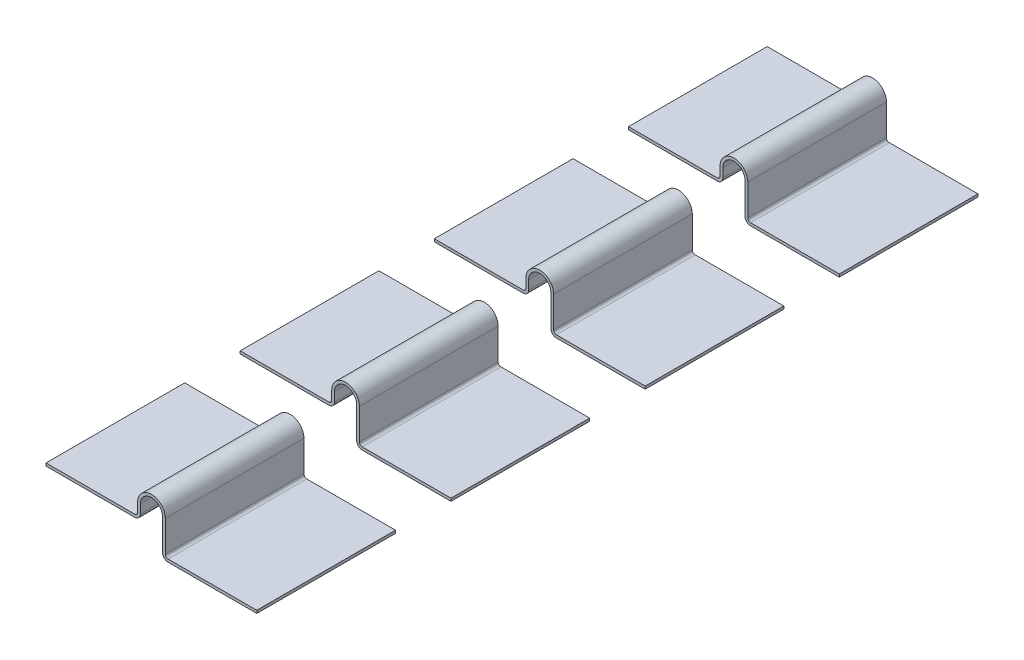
ISO-10303-21;
HEADER;
FILE_DESCRIPTION(('STEP AP214'),'2;1');
FILE_NAME('part.step','',(''),(''),'','','');
FILE_SCHEMA(('AUTOMOTIVE_DESIGN { 1 0 10303 214 1 1 1 1 }'));
ENDSEC;
DATA;
#1=APPLICATION_CONTEXT('core data for automotive mechanical design processes');
#2=APPLICATION_PROTOCOL_DEFINITION('international standard','automotive_design',2000,#1);
#3=PRODUCT_CONTEXT('',#1,'mechanical');
#4=PRODUCT('Part','Part','',(#3));
#5=PRODUCT_RELATED_PRODUCT_CATEGORY('part','',(#4));
#6=PRODUCT_DEFINITION_FORMATION('','',#4);
#7=PRODUCT_DEFINITION_CONTEXT('part definition',#1,'design');
#8=PRODUCT_DEFINITION('design','',#6,#7);
#9=PRODUCT_DEFINITION_SHAPE('','',#8);
#10=(LENGTH_UNIT() NAMED_UNIT(*) SI_UNIT(.MILLI.,.METRE.));
#11=(NAMED_UNIT(*) PLANE_ANGLE_UNIT() SI_UNIT($,.RADIAN.));
#12=(NAMED_UNIT(*) SI_UNIT($,.STERADIAN.) SOLID_ANGLE_UNIT());
#13=UNCERTAINTY_MEASURE_WITH_UNIT(LENGTH_MEASURE(1.E-05),#10,'distance_accuracy_value','');
#14=(GEOMETRIC_REPRESENTATION_CONTEXT(3) GLOBAL_UNCERTAINTY_ASSIGNED_CONTEXT((#13)) GLOBAL_UNIT_ASSIGNED_CONTEXT((#10,
#11,#12)) REPRESENTATION_CONTEXT('',''));
#15=CARTESIAN_POINT('',(0.,0.,0.));
#16=DIRECTION('',(0.,0.,1.));
#17=DIRECTION('',(1.,0.,0.));
#18=AXIS2_PLACEMENT_3D('',#15,#16,#17);
#19=CARTESIAN_POINT('',(7.53,-0.2,0.));
#20=DIRECTION('',(0.,-1.,0.));
#21=DIRECTION('',(0.,0.,-1.));
#22=AXIS2_PLACEMENT_3D('',#19,#20,#21);
#23=PLANE('',#22);
#24=DIRECTION('',(0.,0.,1.));
#25=VECTOR('',#24,1.);
#26=CARTESIAN_POINT('',(1.1,-0.2,0.));
#27=LINE('',#26,#25);
#28=CARTESIAN_POINT('',(1.1,-0.2,1.75));
#29=VERTEX_POINT('',#28);
#30=CARTESIAN_POINT('',(1.1,-0.2,3.));
#31=VERTEX_POINT('',#30);
#32=EDGE_CURVE('P0_E195',#29,#31,#27,.T.);
#33=ORIENTED_EDGE('',*,*,#32,.F.);
#34=DIRECTION('',(1.,0.,0.));
#35=VECTOR('',#34,1.);
#36=CARTESIAN_POINT('',(2.48,-0.2,1.75));
#37=LINE('',#36,#35);
#38=CARTESIAN_POINT('',(1.9,-0.2,1.75));
#39=VERTEX_POINT('',#38);
#40=EDGE_CURVE('P0_E149',#29,#39,#37,.T.);
#41=ORIENTED_EDGE('',*,*,#40,.T.);
#42=DIRECTION('',(0.,0.,1.));
#43=VECTOR('',#42,1.);
#44=CARTESIAN_POINT('',(1.9,-0.2,0.));
#45=LINE('',#44,#43);
#46=CARTESIAN_POINT('',(1.9,-0.2,3.));
#47=VERTEX_POINT('',#46);
#48=EDGE_CURVE('P0_E144',#39,#47,#45,.T.);
#49=ORIENTED_EDGE('',*,*,#48,.T.);
#50=DIRECTION('',(-1.,0.,0.));
#51=VECTOR('',#50,1.);
#52=CARTESIAN_POINT('',(0.,-0.2,3.));
#53=LINE('',#52,#51);
#54=EDGE_CURVE('P0_E159',#47,#31,#53,.T.);
#55=ORIENTED_EDGE('',*,*,#54,.T.);
#56=EDGE_LOOP('',(#33,#41,#49,#55));
#57=FACE_BOUND('',#56,.T.);
#58=ADVANCED_FACE('P0_F17',(#57),#23,.T.);
#59=CARTESIAN_POINT('',(1.1,-0.15,0.));
#60=DIRECTION('',(0.,0.,1.));
#61=DIRECTION('',(1.,0.,0.));
#62=AXIS2_PLACEMENT_3D('',#59,#60,#61);
#63=CYLINDRICAL_SURFACE('',#62,0.05);
#64=CARTESIAN_POINT('',(1.1,-0.15,3.));
#65=DIRECTION('',(0.,0.,1.));
#66=DIRECTION('',(1.,0.,0.));
#67=AXIS2_PLACEMENT_3D('',#64,#65,#66);
#68=CIRCLE('',#67,0.05);
#69=CARTESIAN_POINT('',(1.05,-0.15,3.));
#70=VERTEX_POINT('',#69);
#71=EDGE_CURVE('P0_E217',#31,#70,#68,.F.);
#72=ORIENTED_EDGE('',*,*,#71,.T.);
#73=DIRECTION('',(0.,0.,1.));
#74=VECTOR('',#73,1.);
#75=CARTESIAN_POINT('',(1.05,-0.15,0.));
#76=LINE('',#75,#74);
#77=CARTESIAN_POINT('',(1.05,-0.15,1.75));
#78=VERTEX_POINT('',#77);
#79=EDGE_CURVE('P0_E192',#78,#70,#76,.T.);
#80=ORIENTED_EDGE('',*,*,#79,.F.);
#81=CARTESIAN_POINT('',(1.1,-0.15,1.75));
#82=DIRECTION('',(0.,0.,1.));
#83=DIRECTION('',(1.,0.,0.));
#84=AXIS2_PLACEMENT_3D('',#81,#82,#83);
#85=CIRCLE('',#84,0.05);
#86=EDGE_CURVE('P0_E220',#78,#29,#85,.T.);
#87=ORIENTED_EDGE('',*,*,#86,.T.);
#88=ORIENTED_EDGE('',*,*,#32,.T.);
#89=EDGE_LOOP('',(#72,#80,#87,#88));
#90=FACE_BOUND('',#89,.T.);
#91=ADVANCED_FACE('P0_F313',(#90),#63,.T.);
#92=CARTESIAN_POINT('',(1.05,-0.15,0.));
#93=DIRECTION('',(-1.,0.,0.));
#94=DIRECTION('',(0.,0.,1.));
#95=AXIS2_PLACEMENT_3D('',#92,#93,#94);
#96=PLANE('',#95);
#97=DIRECTION('',(0.,1.,0.));
#98=VECTOR('',#97,1.);
#99=CARTESIAN_POINT('',(1.05,0.025,3.));
#100=LINE('',#99,#98);
#101=CARTESIAN_POINT('',(1.05,0.13,3.));
#102=VERTEX_POINT('',#101);
#103=EDGE_CURVE('P0_E216',#70,#102,#100,.T.);
#104=ORIENTED_EDGE('',*,*,#103,.T.);
#105=DIRECTION('',(0.,0.,1.));
#106=VECTOR('',#105,1.);
#107=CARTESIAN_POINT('',(1.05,0.13,0.));
#108=LINE('',#107,#106);
#109=CARTESIAN_POINT('',(1.05,0.13,1.75));
#110=VERTEX_POINT('',#109);
#111=EDGE_CURVE('P0_E190',#102,#110,#108,.F.);
#112=ORIENTED_EDGE('',*,*,#111,.T.);
#113=DIRECTION('',(0.,1.,0.));
#114=VECTOR('',#113,1.);
#115=CARTESIAN_POINT('',(1.05,0.025,1.75));
#116=LINE('',#115,#114);
#117=EDGE_CURVE('P0_E223',#110,#78,#116,.F.);
#118=ORIENTED_EDGE('',*,*,#117,.T.);
#119=ORIENTED_EDGE('',*,*,#79,.T.);
#120=EDGE_LOOP('',(#104,#112,#118,#119));
#121=FACE_BOUND('',#120,.T.);
#122=ADVANCED_FACE('P0_F307',(#121),#96,.T.);
#123=CARTESIAN_POINT('',(0.95,0.13,0.));
#124=DIRECTION('',(0.,0.,1.));
#125=DIRECTION('',(1.,0.,0.));
#126=AXIS2_PLACEMENT_3D('',#123,#124,#125);
#127=CYLINDRICAL_SURFACE('',#126,0.1);
#128=CARTESIAN_POINT('',(0.950000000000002,0.13,3.));
#129=DIRECTION('',(0.,0.,1.));
#130=DIRECTION('',(1.,0.,0.));
#131=AXIS2_PLACEMENT_3D('',#128,#129,#130);
#132=CIRCLE('',#131,0.1);
#133=CARTESIAN_POINT('',(0.85,0.13,3.));
#134=VERTEX_POINT('',#133);
#135=EDGE_CURVE('P0_E214',#102,#134,#132,.T.);
#136=ORIENTED_EDGE('',*,*,#135,.T.);
#137=DIRECTION('',(0.,0.,-1.));
#138=VECTOR('',#137,1.);
#139=CARTESIAN_POINT('',(0.85,0.13,0.));
#140=LINE('',#139,#138);
#141=CARTESIAN_POINT('',(0.85,0.13,1.75));
#142=VERTEX_POINT('',#141);
#143=EDGE_CURVE('P0_E187',#142,#134,#140,.F.);
#144=ORIENTED_EDGE('',*,*,#143,.F.);
#145=CARTESIAN_POINT('',(0.950000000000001,0.13,1.75));
#146=DIRECTION('',(0.,0.,1.));
#147=DIRECTION('',(1.,0.,0.));
#148=AXIS2_PLACEMENT_3D('',#145,#146,#147);
#149=CIRCLE('',#148,0.1);
#150=EDGE_CURVE('P0_E224',#142,#110,#149,.F.);
#151=ORIENTED_EDGE('',*,*,#150,.T.);
#152=ORIENTED_EDGE('',*,*,#111,.F.);
#153=EDGE_LOOP('',(#136,#144,#151,#152));
#154=FACE_BOUND('',#153,.T.);
#155=ADVANCED_FACE('P0_F438',(#154),#127,.F.);
#156=CARTESIAN_POINT('',(0.85,0.13,0.));
#157=DIRECTION('',(1.,0.,0.));
#158=DIRECTION('',(0.,0.,-1.));
#159=AXIS2_PLACEMENT_3D('',#156,#157,#158);
#160=PLANE('',#159);
#161=DIRECTION('',(0.,1.,0.));
#162=VECTOR('',#161,1.);
#163=CARTESIAN_POINT('',(0.85,0.025,3.));
#164=LINE('',#163,#162);
#165=CARTESIAN_POINT('',(0.850000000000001,0.0499999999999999,3.));
#166=VERTEX_POINT('',#165);
#167=EDGE_CURVE('P0_E213',#134,#166,#164,.F.);
#168=ORIENTED_EDGE('',*,*,#167,.T.);
#169=DIRECTION('',(0.,0.,1.));
#170=VECTOR('',#169,1.);
#171=CARTESIAN_POINT('',(0.85,0.05,0.));
#172=LINE('',#171,#170);
#173=CARTESIAN_POINT('',(0.850000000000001,0.0499999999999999,1.75));
#174=VERTEX_POINT('',#173);
#175=EDGE_CURVE('P0_E184',#174,#166,#172,.T.);
#176=ORIENTED_EDGE('',*,*,#175,.F.);
#177=DIRECTION('',(0.,1.,0.));
#178=VECTOR('',#177,1.);
#179=CARTESIAN_POINT('',(0.85,0.025,1.75));
#180=LINE('',#179,#178);
#181=EDGE_CURVE('P0_E227',#174,#142,#180,.T.);
#182=ORIENTED_EDGE('',*,*,#181,.T.);
#183=ORIENTED_EDGE('',*,*,#143,.T.);
#184=EDGE_LOOP('',(#168,#176,#182,#183));
#185=FACE_BOUND('',#184,.T.);
#186=ADVANCED_FACE('P0_F430',(#185),#160,.T.);
#187=CARTESIAN_POINT('',(0.8,0.05,0.));
#188=DIRECTION('',(0.,0.,1.));
#189=DIRECTION('',(1.,0.,0.));
#190=AXIS2_PLACEMENT_3D('',#187,#188,#189);
#191=CYLINDRICAL_SURFACE('',#190,0.05);
#192=CARTESIAN_POINT('',(0.800000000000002,0.0499999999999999,3.));
#193=DIRECTION('',(0.,0.,1.));
#194=DIRECTION('',(1.,0.,0.));
#195=AXIS2_PLACEMENT_3D('',#192,#193,#194);
#196=CIRCLE('',#195,0.05);
#197=CARTESIAN_POINT('',(0.800000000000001,0.,3.));
#198=VERTEX_POINT('',#197);
#199=EDGE_CURVE('P0_E211',#166,#198,#196,.F.);
#200=ORIENTED_EDGE('',*,*,#199,.T.);
#201=DIRECTION('',(0.,0.,-1.));
#202=VECTOR('',#201,1.);
#203=CARTESIAN_POINT('',(0.8,0.,0.));
#204=LINE('',#203,#202);
#205=CARTESIAN_POINT('',(0.8,0.,1.75));
#206=VERTEX_POINT('',#205);
#207=EDGE_CURVE('P0_E179',#206,#198,#204,.F.);
#208=ORIENTED_EDGE('',*,*,#207,.F.);
#209=CARTESIAN_POINT('',(0.800000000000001,0.0499999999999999,1.75));
#210=DIRECTION('',(0.,0.,1.));
#211=DIRECTION('',(1.,0.,0.));
#212=AXIS2_PLACEMENT_3D('',#209,#210,#211);
#213=CIRCLE('',#212,0.05);
#214=EDGE_CURVE('P0_E228',#206,#174,#213,.T.);
#215=ORIENTED_EDGE('',*,*,#214,.T.);
#216=ORIENTED_EDGE('',*,*,#175,.T.);
#217=EDGE_LOOP('',(#200,#208,#215,#216));
#218=FACE_BOUND('',#217,.T.);
#219=ADVANCED_FACE('P0_F422',(#218),#191,.T.);
#220=CARTESIAN_POINT('',(0.8,0.,0.));
#221=DIRECTION('',(0.,-1.,0.));
#222=DIRECTION('',(0.,0.,-1.));
#223=AXIS2_PLACEMENT_3D('',#220,#221,#222);
#224=PLANE('',#223);
#225=DIRECTION('',(-1.,0.,0.));
#226=VECTOR('',#225,1.);
#227=CARTESIAN_POINT('',(0.,0.,3.));
#228=LINE('',#227,#226);
#229=CARTESIAN_POINT('',(0.,0.,3.));
#230=VERTEX_POINT('',#229);
#231=EDGE_CURVE('P0_E174',#198,#230,#228,.T.);
#232=ORIENTED_EDGE('',*,*,#231,.T.);
#233=DIRECTION('',(0.,0.,1.));
#234=VECTOR('',#233,1.);
#235=CARTESIAN_POINT('',(0.,0.,0.));
#236=LINE('',#235,#234);
#237=CARTESIAN_POINT('',(0.,0.,1.75));
#238=VERTEX_POINT('',#237);
#239=EDGE_CURVE('P0_E167',#238,#230,#236,.T.);
#240=ORIENTED_EDGE('',*,*,#239,.F.);
#241=DIRECTION('',(1.,0.,0.));
#242=VECTOR('',#241,1.);
#243=CARTESIAN_POINT('',(2.48,0.,1.75));
#244=LINE('',#243,#242);
#245=EDGE_CURVE('P0_E201',#238,#206,#244,.T.);
#246=ORIENTED_EDGE('',*,*,#245,.T.);
#247=ORIENTED_EDGE('',*,*,#207,.T.);
#248=EDGE_LOOP('',(#232,#240,#246,#247));
#249=FACE_BOUND('',#248,.T.);
#250=ADVANCED_FACE('P0_F414',(#249),#224,.T.);
#251=CARTESIAN_POINT('',(0.,0.,0.));
#252=DIRECTION('',(-1.,0.,0.));
#253=DIRECTION('',(0.,0.,1.));
#254=AXIS2_PLACEMENT_3D('',#251,#252,#253);
#255=PLANE('',#254);
#256=DIRECTION('',(0.,1.,0.));
#257=VECTOR('',#256,1.);
#258=CARTESIAN_POINT('',(0.,0.025,3.));
#259=LINE('',#258,#257);
#260=CARTESIAN_POINT('',(0.,0.025,3.));
#261=VERTEX_POINT('',#260);
#262=EDGE_CURVE('P0_E170',#230,#261,#259,.T.);
#263=ORIENTED_EDGE('',*,*,#262,.T.);
#264=DIRECTION('',(0.,0.,1.));
#265=VECTOR('',#264,1.);
#266=CARTESIAN_POINT('',(0.,0.025,0.));
#267=LINE('',#266,#265);
#268=CARTESIAN_POINT('',(0.,0.025,1.75));
#269=VERTEX_POINT('',#268);
#270=EDGE_CURVE('P0_E164',#269,#261,#267,.T.);
#271=ORIENTED_EDGE('',*,*,#270,.F.);
#272=DIRECTION('',(0.,1.,0.));
#273=VECTOR('',#272,1.);
#274=CARTESIAN_POINT('',(0.,0.025,1.75));
#275=LINE('',#274,#273);
#276=EDGE_CURVE('P0_E198',#269,#238,#275,.F.);
#277=ORIENTED_EDGE('',*,*,#276,.T.);
#278=ORIENTED_EDGE('',*,*,#239,.T.);
#279=EDGE_LOOP('',(#263,#271,#277,#278));
#280=FACE_BOUND('',#279,.T.);
#281=ADVANCED_FACE('P0_F252',(#280),#255,.T.);
#282=CARTESIAN_POINT('',(0.,0.025,0.));
#283=DIRECTION('',(0.,1.,0.));
#284=DIRECTION('',(0.,0.,1.));
#285=AXIS2_PLACEMENT_3D('',#282,#283,#284);
#286=PLANE('',#285);
#287=DIRECTION('',(-1.,0.,0.));
#288=VECTOR('',#287,1.);
#289=CARTESIAN_POINT('',(0.,0.025,3.));
#290=LINE('',#289,#288);
#291=CARTESIAN_POINT('',(0.800000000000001,0.0249999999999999,3.));
#292=VERTEX_POINT('',#291);
#293=EDGE_CURVE('P0_E173',#261,#292,#290,.F.);
#294=ORIENTED_EDGE('',*,*,#293,.T.);
#295=DIRECTION('',(0.,0.,1.));
#296=VECTOR('',#295,1.);
#297=CARTESIAN_POINT('',(0.799999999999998,0.025,0.));
#298=LINE('',#297,#296);
#299=CARTESIAN_POINT('',(0.8,0.025,1.75));
#300=VERTEX_POINT('',#299);
#301=EDGE_CURVE('P0_E162',#292,#300,#298,.F.);
#302=ORIENTED_EDGE('',*,*,#301,.T.);
#303=DIRECTION('',(1.,0.,0.));
#304=VECTOR('',#303,1.);
#305=CARTESIAN_POINT('',(2.48,0.025,1.75));
#306=LINE('',#305,#304);
#307=EDGE_CURVE('P0_E138',#300,#269,#306,.F.);
#308=ORIENTED_EDGE('',*,*,#307,.T.);
#309=ORIENTED_EDGE('',*,*,#270,.T.);
#310=EDGE_LOOP('',(#294,#302,#308,#309));
#311=FACE_BOUND('',#310,.T.);
#312=ADVANCED_FACE('P0_F246',(#311),#286,.T.);
#313=CARTESIAN_POINT('',(0.8,0.05,0.));
#314=DIRECTION('',(0.,0.,1.));
#315=DIRECTION('',(1.,0.,0.));
#316=AXIS2_PLACEMENT_3D('',#313,#314,#315);
#317=CYLINDRICAL_SURFACE('',#316,0.025);
#318=CARTESIAN_POINT('',(0.800000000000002,0.0499999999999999,3.));
#319=DIRECTION('',(0.,0.,1.));
#320=DIRECTION('',(1.,0.,0.));
#321=AXIS2_PLACEMENT_3D('',#318,#319,#320);
#322=CIRCLE('',#321,0.025);
#323=CARTESIAN_POINT('',(0.825,0.0499999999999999,3.));
#324=VERTEX_POINT('',#323);
#325=EDGE_CURVE('P0_E209',#292,#324,#322,.T.);
#326=ORIENTED_EDGE('',*,*,#325,.T.);
#327=DIRECTION('',(0.,0.,1.));
#328=VECTOR('',#327,1.);
#329=CARTESIAN_POINT('',(0.825,0.05,0.));
#330=LINE('',#329,#328);
#331=CARTESIAN_POINT('',(0.825,0.05,1.75));
#332=VERTEX_POINT('',#331);
#333=EDGE_CURVE('P0_E126',#332,#324,#330,.T.);
#334=ORIENTED_EDGE('',*,*,#333,.F.);
#335=CARTESIAN_POINT('',(0.800000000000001,0.0499999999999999,1.75));
#336=DIRECTION('',(0.,0.,1.));
#337=DIRECTION('',(1.,0.,0.));
#338=AXIS2_PLACEMENT_3D('',#335,#336,#337);
#339=CIRCLE('',#338,0.025);
#340=EDGE_CURVE('P0_E136',#332,#300,#339,.F.);
#341=ORIENTED_EDGE('',*,*,#340,.T.);
#342=ORIENTED_EDGE('',*,*,#301,.F.);
#343=EDGE_LOOP('',(#326,#334,#341,#342));
#344=FACE_BOUND('',#343,.T.);
#345=ADVANCED_FACE('P0_F391',(#344),#317,.F.);
#346=CARTESIAN_POINT('',(0.825,0.05,0.));
#347=DIRECTION('',(-1.,0.,0.));
#348=DIRECTION('',(0.,0.,1.));
#349=AXIS2_PLACEMENT_3D('',#346,#347,#348);
#350=PLANE('',#349);
#351=DIRECTION('',(0.,1.,0.));
#352=VECTOR('',#351,1.);
#353=CARTESIAN_POINT('',(0.825,0.025,3.));
#354=LINE('',#353,#352);
#355=CARTESIAN_POINT('',(0.825000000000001,0.13,3.));
#356=VERTEX_POINT('',#355);
#357=EDGE_CURVE('P0_E124',#324,#356,#354,.T.);
#358=ORIENTED_EDGE('',*,*,#357,.T.);
#359=DIRECTION('',(0.,0.,1.));
#360=VECTOR('',#359,1.);
#361=CARTESIAN_POINT('',(0.825,0.13,0.));
#362=LINE('',#361,#360);
#363=CARTESIAN_POINT('',(0.825,0.13,1.75));
#364=VERTEX_POINT('',#363);
#365=EDGE_CURVE('P0_E117',#364,#356,#362,.T.);
#366=ORIENTED_EDGE('',*,*,#365,.F.);
#367=DIRECTION('',(0.,1.,0.));
#368=VECTOR('',#367,1.);
#369=CARTESIAN_POINT('',(0.825,0.025,1.75));
#370=LINE('',#369,#368);
#371=EDGE_CURVE('P0_E121',#364,#332,#370,.F.);
#372=ORIENTED_EDGE('',*,*,#371,.T.);
#373=ORIENTED_EDGE('',*,*,#333,.T.);
#374=EDGE_LOOP('',(#358,#366,#372,#373));
#375=FACE_BOUND('',#374,.T.);
#376=ADVANCED_FACE('P0_F118',(#375),#350,.T.);
#377=CARTESIAN_POINT('',(0.95,0.13,0.));
#378=DIRECTION('',(0.,0.,1.));
#379=DIRECTION('',(1.,0.,0.));
#380=AXIS2_PLACEMENT_3D('',#377,#378,#379);
#381=CYLINDRICAL_SURFACE('',#380,0.125);
#382=CARTESIAN_POINT('',(0.950000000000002,0.13,3.));
#383=DIRECTION('',(0.,0.,1.));
#384=DIRECTION('',(1.,0.,0.));
#385=AXIS2_PLACEMENT_3D('',#382,#383,#384);
#386=CIRCLE('',#385,0.125);
#387=CARTESIAN_POINT('',(1.075,0.13,3.));
#388=VERTEX_POINT('',#387);
#389=EDGE_CURVE('P0_E207',#356,#388,#386,.F.);
#390=ORIENTED_EDGE('',*,*,#389,.T.);
#391=DIRECTION('',(0.,0.,-1.));
#392=VECTOR('',#391,1.);
#393=CARTESIAN_POINT('',(1.075,0.13,0.));
#394=LINE('',#393,#392);
#395=CARTESIAN_POINT('',(1.075,0.13,1.75));
#396=VERTEX_POINT('',#395);
#397=EDGE_CURVE('P0_E111',#396,#388,#394,.F.);
#398=ORIENTED_EDGE('',*,*,#397,.F.);
#399=CARTESIAN_POINT('',(0.950000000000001,0.13,1.75));
#400=DIRECTION('',(0.,0.,1.));
#401=DIRECTION('',(1.,0.,0.));
#402=AXIS2_PLACEMENT_3D('',#399,#400,#401);
#403=CIRCLE('',#402,0.125);
#404=EDGE_CURVE('P0_E20',#396,#364,#403,.T.);
#405=ORIENTED_EDGE('',*,*,#404,.T.);
#406=ORIENTED_EDGE('',*,*,#365,.T.);
#407=EDGE_LOOP('',(#390,#398,#405,#406));
#408=FACE_BOUND('',#407,.T.);
#409=ADVANCED_FACE('P0_F129',(#408),#381,.T.);
#410=CARTESIAN_POINT('',(1.075,0.13,0.));
#411=DIRECTION('',(1.,0.,0.));
#412=DIRECTION('',(0.,0.,-1.));
#413=AXIS2_PLACEMENT_3D('',#410,#411,#412);
#414=PLANE('',#413);
#415=DIRECTION('',(0.,1.,0.));
#416=VECTOR('',#415,1.);
#417=CARTESIAN_POINT('',(1.075,0.025,3.));
#418=LINE('',#417,#416);
#419=CARTESIAN_POINT('',(1.075,-0.15,3.));
#420=VERTEX_POINT('',#419);
#421=EDGE_CURVE('P0_E206',#388,#420,#418,.F.);
#422=ORIENTED_EDGE('',*,*,#421,.T.);
#423=DIRECTION('',(0.,0.,1.));
#424=VECTOR('',#423,1.);
#425=CARTESIAN_POINT('',(1.075,-0.15,0.));
#426=LINE('',#425,#424);
#427=CARTESIAN_POINT('',(1.075,-0.15,1.75));
#428=VERTEX_POINT('',#427);
#429=EDGE_CURVE('P0_E156',#420,#428,#426,.F.);
#430=ORIENTED_EDGE('',*,*,#429,.T.);
#431=DIRECTION('',(0.,1.,0.));
#432=VECTOR('',#431,1.);
#433=CARTESIAN_POINT('',(1.075,0.025,1.75));
#434=LINE('',#433,#432);
#435=EDGE_CURVE('P0_E131',#428,#396,#434,.T.);
#436=ORIENTED_EDGE('',*,*,#435,.T.);
#437=ORIENTED_EDGE('',*,*,#397,.T.);
#438=EDGE_LOOP('',(#422,#430,#436,#437));
#439=FACE_BOUND('',#438,.T.);
#440=ADVANCED_FACE('P0_F272',(#439),#414,.T.);
#441=CARTESIAN_POINT('',(1.9,-0.175,0.));
#442=DIRECTION('',(-1.,0.,0.));
#443=DIRECTION('',(0.,0.,1.));
#444=AXIS2_PLACEMENT_3D('',#441,#442,#443);
#445=PLANE('',#444);
#446=ORIENTED_EDGE('',*,*,#48,.F.);
#447=DIRECTION('',(0.,1.,0.));
#448=VECTOR('',#447,1.);
#449=CARTESIAN_POINT('',(1.9,0.025,1.75));
#450=LINE('',#449,#448);
#451=CARTESIAN_POINT('',(1.9,-0.175,1.75));
#452=VERTEX_POINT('',#451);
#453=EDGE_CURVE('P0_E145',#39,#452,#450,.T.);
#454=ORIENTED_EDGE('',*,*,#453,.T.);
#455=DIRECTION('',(0.,0.,1.));
#456=VECTOR('',#455,1.);
#457=CARTESIAN_POINT('',(1.9,-0.175,0.));
#458=LINE('',#457,#456);
#459=CARTESIAN_POINT('',(1.9,-0.175,3.));
#460=VERTEX_POINT('',#459);
#461=EDGE_CURVE('P0_E267',#460,#452,#458,.F.);
#462=ORIENTED_EDGE('',*,*,#461,.F.);
#463=DIRECTION('',(0.,1.,0.));
#464=VECTOR('',#463,1.);
#465=CARTESIAN_POINT('',(1.9,0.025,3.));
#466=LINE('',#465,#464);
#467=EDGE_CURVE('P0_E205',#460,#47,#466,.F.);
#468=ORIENTED_EDGE('',*,*,#467,.T.);
#469=EDGE_LOOP('',(#446,#454,#462,#468));
#470=FACE_BOUND('',#469,.T.);
#471=ADVANCED_FACE('P0_F322',(#470),#445,.F.);
#472=CARTESIAN_POINT('',(2.48,0.025,1.75));
#473=DIRECTION('',(0.,0.,1.));
#474=DIRECTION('',(1.,0.,0.));
#475=AXIS2_PLACEMENT_3D('',#472,#473,#474);
#476=PLANE('',#475);
#477=ORIENTED_EDGE('',*,*,#40,.F.);
#478=ORIENTED_EDGE('',*,*,#86,.F.);
#479=ORIENTED_EDGE('',*,*,#117,.F.);
#480=ORIENTED_EDGE('',*,*,#150,.F.);
#481=ORIENTED_EDGE('',*,*,#181,.F.);
#482=ORIENTED_EDGE('',*,*,#214,.F.);
#483=ORIENTED_EDGE('',*,*,#245,.F.);
#484=ORIENTED_EDGE('',*,*,#276,.F.);
#485=ORIENTED_EDGE('',*,*,#307,.F.);
#486=ORIENTED_EDGE('',*,*,#340,.F.);
#487=ORIENTED_EDGE('',*,*,#371,.F.);
#488=ORIENTED_EDGE('',*,*,#404,.F.);
#489=ORIENTED_EDGE('',*,*,#435,.F.);
#490=CARTESIAN_POINT('',(1.1,-0.15,1.75));
#491=DIRECTION('',(0.,0.,1.));
#492=DIRECTION('',(1.,0.,0.));
#493=AXIS2_PLACEMENT_3D('',#490,#491,#492);
#494=CIRCLE('',#493,0.025);
#495=CARTESIAN_POINT('',(1.1,-0.175,1.75));
#496=VERTEX_POINT('',#495);
#497=EDGE_CURVE('P0_E148',#428,#496,#494,.T.);
#498=ORIENTED_EDGE('',*,*,#497,.T.);
#499=DIRECTION('',(1.,0.,0.));
#500=VECTOR('',#499,1.);
#501=CARTESIAN_POINT('',(1.1,-0.175,1.75));
#502=LINE('',#501,#500);
#503=EDGE_CURVE('P0_E284',#452,#496,#502,.F.);
#504=ORIENTED_EDGE('',*,*,#503,.F.);
#505=ORIENTED_EDGE('',*,*,#453,.F.);
#506=EDGE_LOOP('',(#477,#478,#479,#480,#481,#482,#483,#484,#485,#486,#487,#488,#489,#498,#504,#505));
#507=FACE_BOUND('',#506,.T.);
#508=ADVANCED_FACE('P0_F133',(#507),#476,.F.);
#509=CARTESIAN_POINT('',(1.1,-0.15,0.));
#510=DIRECTION('',(0.,0.,1.));
#511=DIRECTION('',(1.,0.,0.));
#512=AXIS2_PLACEMENT_3D('',#509,#510,#511);
#513=CYLINDRICAL_SURFACE('',#512,0.025);
#514=CARTESIAN_POINT('',(1.1,-0.15,3.));
#515=DIRECTION('',(0.,0.,1.));
#516=DIRECTION('',(1.,0.,0.));
#517=AXIS2_PLACEMENT_3D('',#514,#515,#516);
#518=CIRCLE('',#517,0.025);
#519=CARTESIAN_POINT('',(1.1,-0.175,3.));
#520=VERTEX_POINT('',#519);
#521=EDGE_CURVE('P0_E35',#420,#520,#518,.T.);
#522=ORIENTED_EDGE('',*,*,#521,.T.);
#523=DIRECTION('',(0.,0.,1.));
#524=VECTOR('',#523,1.);
#525=CARTESIAN_POINT('',(1.1,-0.175,0.));
#526=LINE('',#525,#524);
#527=EDGE_CURVE('P0_E26',#496,#520,#526,.T.);
#528=ORIENTED_EDGE('',*,*,#527,.F.);
#529=ORIENTED_EDGE('',*,*,#497,.F.);
#530=ORIENTED_EDGE('',*,*,#429,.F.);
#531=EDGE_LOOP('',(#522,#528,#529,#530));
#532=FACE_BOUND('',#531,.T.);
#533=ADVANCED_FACE('P0_F276',(#532),#513,.F.);
#534=CARTESIAN_POINT('',(0.,0.025,3.));
#535=DIRECTION('',(0.,0.,-1.));
#536=DIRECTION('',(-1.,0.,0.));
#537=AXIS2_PLACEMENT_3D('',#534,#535,#536);
#538=PLANE('',#537);
#539=DIRECTION('',(1.,0.,0.));
#540=VECTOR('',#539,1.);
#541=CARTESIAN_POINT('',(1.1,-0.175,3.));
#542=LINE('',#541,#540);
#543=EDGE_CURVE('P0_E11',#520,#460,#542,.T.);
#544=ORIENTED_EDGE('',*,*,#543,.F.);
#545=ORIENTED_EDGE('',*,*,#521,.F.);
#546=ORIENTED_EDGE('',*,*,#421,.F.);
#547=ORIENTED_EDGE('',*,*,#389,.F.);
#548=ORIENTED_EDGE('',*,*,#357,.F.);
#549=ORIENTED_EDGE('',*,*,#325,.F.);
#550=ORIENTED_EDGE('',*,*,#293,.F.);
#551=ORIENTED_EDGE('',*,*,#262,.F.);
#552=ORIENTED_EDGE('',*,*,#231,.F.);
#553=ORIENTED_EDGE('',*,*,#199,.F.);
#554=ORIENTED_EDGE('',*,*,#167,.F.);
#555=ORIENTED_EDGE('',*,*,#135,.F.);
#556=ORIENTED_EDGE('',*,*,#103,.F.);
#557=ORIENTED_EDGE('',*,*,#71,.F.);
#558=ORIENTED_EDGE('',*,*,#54,.F.);
#559=ORIENTED_EDGE('',*,*,#467,.F.);
#560=EDGE_LOOP('',(#544,#545,#546,#547,#548,#549,#550,#551,#552,#553,#554,#555,#556,#557,#558,#559));
#561=FACE_BOUND('',#560,.T.);
#562=ADVANCED_FACE('P0_F277',(#561),#538,.F.);
#563=CARTESIAN_POINT('',(1.1,-0.175,0.));
#564=DIRECTION('',(0.,1.,0.));
#565=DIRECTION('',(0.,0.,1.));
#566=AXIS2_PLACEMENT_3D('',#563,#564,#565);
#567=PLANE('',#566);
#568=ORIENTED_EDGE('',*,*,#527,.T.);
#569=ORIENTED_EDGE('',*,*,#543,.T.);
#570=ORIENTED_EDGE('',*,*,#461,.T.);
#571=ORIENTED_EDGE('',*,*,#503,.T.);
#572=EDGE_LOOP('',(#568,#569,#570,#571));
#573=FACE_BOUND('',#572,.T.);
#574=ADVANCED_FACE('P0_F282',(#573),#567,.T.);
#575=CLOSED_SHELL('',(#58,#91,#122,#155,#186,#219,#250,#281,#312,#345,#376,#409,#440,#471,#508,
#533,#562,#574));
#576=MANIFOLD_SOLID_BREP('P0_B1',#575);
#577=CARTESIAN_POINT('',(1.075,0.13,0.));
#578=DIRECTION('',(1.,0.,0.));
#579=DIRECTION('',(0.,0.,-1.));
#580=AXIS2_PLACEMENT_3D('',#577,#578,#579);
#581=PLANE('',#580);
#582=DIRECTION('',(0.,1.,0.));
#583=VECTOR('',#582,1.);
#584=CARTESIAN_POINT('',(1.075,-0.139909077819,6.5));
#585=LINE('',#584,#583);
#586=CARTESIAN_POINT('',(1.075,-0.15,6.5));
#587=VERTEX_POINT('',#586);
#588=CARTESIAN_POINT('',(1.075,0.13,6.5));
#589=VERTEX_POINT('',#588);
#590=EDGE_CURVE('P1_E196',#587,#589,#585,.T.);
#591=ORIENTED_EDGE('',*,*,#590,.F.);
#592=DIRECTION('',(0.,0.,1.));
#593=VECTOR('',#592,1.);
#594=CARTESIAN_POINT('',(1.075,-0.15,0.));
#595=LINE('',#594,#593);
#596=CARTESIAN_POINT('',(1.075,-0.15,5.25));
#597=VERTEX_POINT('',#596);
#598=EDGE_CURVE('P1_E166',#587,#597,#595,.F.);
#599=ORIENTED_EDGE('',*,*,#598,.T.);
#600=DIRECTION('',(0.,1.,0.));
#601=VECTOR('',#600,1.);
#602=CARTESIAN_POINT('',(1.075,0.025,5.25));
#603=LINE('',#602,#601);
#604=CARTESIAN_POINT('',(1.075,0.13,5.25));
#605=VERTEX_POINT('',#604);
#606=EDGE_CURVE('P1_E82',#597,#605,#603,.T.);
#607=ORIENTED_EDGE('',*,*,#606,.T.);
#608=DIRECTION('',(0.,0.,1.));
#609=VECTOR('',#608,1.);
#610=CARTESIAN_POINT('',(1.075,0.13,0.));
#611=LINE('',#610,#609);
#612=EDGE_CURVE('P1_E93',#589,#605,#611,.F.);
#613=ORIENTED_EDGE('',*,*,#612,.F.);
#614=EDGE_LOOP('',(#591,#599,#607,#613));
#615=FACE_BOUND('',#614,.T.);
#616=ADVANCED_FACE('P1_F17',(#615),#581,.T.);
#617=CARTESIAN_POINT('',(0.95,0.13,0.));
#618=DIRECTION('',(0.,0.,1.));
#619=DIRECTION('',(1.,0.,0.));
#620=AXIS2_PLACEMENT_3D('',#617,#618,#619);
#621=CYLINDRICAL_SURFACE('',#620,0.125);
#622=CARTESIAN_POINT('',(0.950000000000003,0.13,6.5));
#623=DIRECTION('',(0.,0.,1.));
#624=DIRECTION('',(1.,0.,0.));
#625=AXIS2_PLACEMENT_3D('',#622,#623,#624);
#626=CIRCLE('',#625,0.125);
#627=CARTESIAN_POINT('',(0.825,0.13,6.5));
#628=VERTEX_POINT('',#627);
#629=EDGE_CURVE('P1_E194',#589,#628,#626,.T.);
#630=ORIENTED_EDGE('',*,*,#629,.F.);
#631=ORIENTED_EDGE('',*,*,#612,.T.);
#632=CARTESIAN_POINT('',(0.950000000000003,0.13,5.25));
#633=DIRECTION('',(0.,0.,1.));
#634=DIRECTION('',(1.,0.,0.));
#635=AXIS2_PLACEMENT_3D('',#632,#633,#634);
#636=CIRCLE('',#635,0.125);
#637=CARTESIAN_POINT('',(0.825,0.13,5.25));
#638=VERTEX_POINT('',#637);
#639=EDGE_CURVE('P1_E20',#605,#638,#636,.T.);
#640=ORIENTED_EDGE('',*,*,#639,.T.);
#641=DIRECTION('',(0.,0.,1.));
#642=VECTOR('',#641,1.);
#643=CARTESIAN_POINT('',(0.825,0.13,0.));
#644=LINE('',#643,#642);
#645=EDGE_CURVE('P1_E91',#628,#638,#644,.F.);
#646=ORIENTED_EDGE('',*,*,#645,.F.);
#647=EDGE_LOOP('',(#630,#631,#640,#646));
#648=FACE_BOUND('',#647,.T.);
#649=ADVANCED_FACE('P1_F90',(#648),#621,.T.);
#650=CARTESIAN_POINT('',(0.825,0.05,0.));
#651=DIRECTION('',(-1.,0.,0.));
#652=DIRECTION('',(0.,0.,1.));
#653=AXIS2_PLACEMENT_3D('',#650,#651,#652);
#654=PLANE('',#653);
#655=DIRECTION('',(0.,1.,0.));
#656=VECTOR('',#655,1.);
#657=CARTESIAN_POINT('',(0.825,-0.139909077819,6.5));
#658=LINE('',#657,#656);
#659=CARTESIAN_POINT('',(0.825000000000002,0.0499999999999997,6.5));
#660=VERTEX_POINT('',#659);
#661=EDGE_CURVE('P1_E102',#628,#660,#658,.F.);
#662=ORIENTED_EDGE('',*,*,#661,.F.);
#663=ORIENTED_EDGE('',*,*,#645,.T.);
#664=DIRECTION('',(0.,1.,0.));
#665=VECTOR('',#664,1.);
#666=CARTESIAN_POINT('',(0.825,0.025,5.25));
#667=LINE('',#666,#665);
#668=CARTESIAN_POINT('',(0.825000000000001,0.0499999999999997,5.25));
#669=VERTEX_POINT('',#668);
#670=EDGE_CURVE('P1_E96',#638,#669,#667,.F.);
#671=ORIENTED_EDGE('',*,*,#670,.T.);
#672=DIRECTION('',(0.,0.,1.));
#673=VECTOR('',#672,1.);
#674=CARTESIAN_POINT('',(0.825,0.05,0.));
#675=LINE('',#674,#673);
#676=EDGE_CURVE('P1_E104',#669,#660,#675,.T.);
#677=ORIENTED_EDGE('',*,*,#676,.T.);
#678=EDGE_LOOP('',(#662,#663,#671,#677));
#679=FACE_BOUND('',#678,.T.);
#680=ADVANCED_FACE('P1_F98',(#679),#654,.T.);
#681=CARTESIAN_POINT('',(0.8,0.05,0.));
#682=DIRECTION('',(0.,0.,1.));
#683=DIRECTION('',(1.,0.,0.));
#684=AXIS2_PLACEMENT_3D('',#681,#682,#683);
#685=CYLINDRICAL_SURFACE('',#684,0.025);
#686=CARTESIAN_POINT('',(0.800000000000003,0.0499999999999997,6.5));
#687=DIRECTION('',(0.,0.,1.));
#688=DIRECTION('',(1.,0.,0.));
#689=AXIS2_PLACEMENT_3D('',#686,#687,#688);
#690=CIRCLE('',#689,0.025);
#691=CARTESIAN_POINT('',(0.800000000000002,0.025,6.5));
#692=VERTEX_POINT('',#691);
#693=EDGE_CURVE('P1_E191',#660,#692,#690,.F.);
#694=ORIENTED_EDGE('',*,*,#693,.F.);
#695=ORIENTED_EDGE('',*,*,#676,.F.);
#696=CARTESIAN_POINT('',(0.800000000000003,0.0499999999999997,5.25));
#697=DIRECTION('',(0.,0.,1.));
#698=DIRECTION('',(1.,0.,0.));
#699=AXIS2_PLACEMENT_3D('',#696,#697,#698);
#700=CIRCLE('',#699,0.025);
#701=CARTESIAN_POINT('',(0.800000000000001,0.025,5.25));
#702=VERTEX_POINT('',#701);
#703=EDGE_CURVE('P1_E110',#669,#702,#700,.F.);
#704=ORIENTED_EDGE('',*,*,#703,.T.);
#705=DIRECTION('',(0.,0.,1.));
#706=VECTOR('',#705,1.);
#707=CARTESIAN_POINT('',(0.8,0.025,0.));
#708=LINE('',#707,#706);
#709=EDGE_CURVE('P1_E159',#692,#702,#708,.F.);
#710=ORIENTED_EDGE('',*,*,#709,.F.);
#711=EDGE_LOOP('',(#694,#695,#704,#710));
#712=FACE_BOUND('',#711,.T.);
#713=ADVANCED_FACE('P1_F322',(#712),#685,.F.);
#714=CARTESIAN_POINT('',(0.,0.025,0.));
#715=DIRECTION('',(0.,1.,0.));
#716=DIRECTION('',(0.,0.,1.));
#717=AXIS2_PLACEMENT_3D('',#714,#715,#716);
#718=PLANE('',#717);
#719=DIRECTION('',(1.,0.,0.));
#720=VECTOR('',#719,1.);
#721=CARTESIAN_POINT('',(3.582846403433,0.025,6.5));
#722=LINE('',#721,#720);
#723=CARTESIAN_POINT('',(0.,0.025,6.5));
#724=VERTEX_POINT('',#723);
#725=EDGE_CURVE('P1_E154',#692,#724,#722,.F.);
#726=ORIENTED_EDGE('',*,*,#725,.F.);
#727=ORIENTED_EDGE('',*,*,#709,.T.);
#728=DIRECTION('',(1.,0.,0.));
#729=VECTOR('',#728,1.);
#730=CARTESIAN_POINT('',(2.48,0.025,5.25));
#731=LINE('',#730,#729);
#732=CARTESIAN_POINT('',(0.,0.025,5.25));
#733=VERTEX_POINT('',#732);
#734=EDGE_CURVE('P1_E112',#702,#733,#731,.F.);
#735=ORIENTED_EDGE('',*,*,#734,.T.);
#736=DIRECTION('',(0.,0.,1.));
#737=VECTOR('',#736,1.);
#738=CARTESIAN_POINT('',(0.,0.025,0.));
#739=LINE('',#738,#737);
#740=EDGE_CURVE('P1_E147',#724,#733,#739,.F.);
#741=ORIENTED_EDGE('',*,*,#740,.F.);
#742=EDGE_LOOP('',(#726,#727,#735,#741));
#743=FACE_BOUND('',#742,.T.);
#744=ADVANCED_FACE('P1_F221',(#743),#718,.T.);
#745=CARTESIAN_POINT('',(0.,0.,0.));
#746=DIRECTION('',(-1.,0.,0.));
#747=DIRECTION('',(0.,0.,1.));
#748=AXIS2_PLACEMENT_3D('',#745,#746,#747);
#749=PLANE('',#748);
#750=DIRECTION('',(0.,1.,0.));
#751=VECTOR('',#750,1.);
#752=CARTESIAN_POINT('',(0.,-0.139909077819,6.5));
#753=LINE('',#752,#751);
#754=CARTESIAN_POINT('',(0.,0.,6.5));
#755=VERTEX_POINT('',#754);
#756=EDGE_CURVE('P1_E150',#724,#755,#753,.F.);
#757=ORIENTED_EDGE('',*,*,#756,.F.);
#758=ORIENTED_EDGE('',*,*,#740,.T.);
#759=DIRECTION('',(0.,1.,0.));
#760=VECTOR('',#759,1.);
#761=CARTESIAN_POINT('',(0.,0.025,5.25));
#762=LINE('',#761,#760);
#763=CARTESIAN_POINT('',(0.,0.,5.25));
#764=VERTEX_POINT('',#763);
#765=EDGE_CURVE('P1_E173',#733,#764,#762,.F.);
#766=ORIENTED_EDGE('',*,*,#765,.T.);
#767=DIRECTION('',(0.,0.,-1.));
#768=VECTOR('',#767,1.);
#769=CARTESIAN_POINT('',(0.,0.,0.));
#770=LINE('',#769,#768);
#771=EDGE_CURVE('P1_E144',#755,#764,#770,.T.);
#772=ORIENTED_EDGE('',*,*,#771,.F.);
#773=EDGE_LOOP('',(#757,#758,#766,#772));
#774=FACE_BOUND('',#773,.T.);
#775=ADVANCED_FACE('P1_F228',(#774),#749,.T.);
#776=CARTESIAN_POINT('',(0.8,0.,0.));
#777=DIRECTION('',(0.,-1.,0.));
#778=DIRECTION('',(0.,0.,-1.));
#779=AXIS2_PLACEMENT_3D('',#776,#777,#778);
#780=PLANE('',#779);
#781=DIRECTION('',(1.,0.,0.));
#782=VECTOR('',#781,1.);
#783=CARTESIAN_POINT('',(3.582846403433,0.,6.5));
#784=LINE('',#783,#782);
#785=CARTESIAN_POINT('',(0.800000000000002,0.,6.5));
#786=VERTEX_POINT('',#785);
#787=EDGE_CURVE('P1_E153',#755,#786,#784,.T.);
#788=ORIENTED_EDGE('',*,*,#787,.F.);
#789=ORIENTED_EDGE('',*,*,#771,.T.);
#790=DIRECTION('',(1.,0.,0.));
#791=VECTOR('',#790,1.);
#792=CARTESIAN_POINT('',(2.48,0.,5.25));
#793=LINE('',#792,#791);
#794=CARTESIAN_POINT('',(0.800000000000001,0.,5.25));
#795=VERTEX_POINT('',#794);
#796=EDGE_CURVE('P1_E176',#764,#795,#793,.T.);
#797=ORIENTED_EDGE('',*,*,#796,.T.);
#798=DIRECTION('',(0.,0.,1.));
#799=VECTOR('',#798,1.);
#800=CARTESIAN_POINT('',(0.799999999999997,0.,0.));
#801=LINE('',#800,#799);
#802=EDGE_CURVE('P1_E141',#786,#795,#801,.F.);
#803=ORIENTED_EDGE('',*,*,#802,.F.);
#804=EDGE_LOOP('',(#788,#789,#797,#803));
#805=FACE_BOUND('',#804,.T.);
#806=ADVANCED_FACE('P1_F365',(#805),#780,.T.);
#807=CARTESIAN_POINT('',(0.8,0.05,0.));
#808=DIRECTION('',(0.,0.,1.));
#809=DIRECTION('',(1.,0.,0.));
#810=AXIS2_PLACEMENT_3D('',#807,#808,#809);
#811=CYLINDRICAL_SURFACE('',#810,0.05);
#812=CARTESIAN_POINT('',(0.800000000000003,0.0499999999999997,6.5));
#813=DIRECTION('',(0.,0.,1.));
#814=DIRECTION('',(1.,0.,0.));
#815=AXIS2_PLACEMENT_3D('',#812,#813,#814);
#816=CIRCLE('',#815,0.05);
#817=CARTESIAN_POINT('',(0.85,0.0499999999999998,6.5));
#818=VERTEX_POINT('',#817);
#819=EDGE_CURVE('P1_E188',#786,#818,#816,.T.);
#820=ORIENTED_EDGE('',*,*,#819,.F.);
#821=ORIENTED_EDGE('',*,*,#802,.T.);
#822=CARTESIAN_POINT('',(0.800000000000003,0.0499999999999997,5.25));
#823=DIRECTION('',(0.,0.,1.));
#824=DIRECTION('',(1.,0.,0.));
#825=AXIS2_PLACEMENT_3D('',#822,#823,#824);
#826=CIRCLE('',#825,0.05);
#827=CARTESIAN_POINT('',(0.85,0.0499999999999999,5.25));
#828=VERTEX_POINT('',#827);
#829=EDGE_CURVE('P1_E205',#795,#828,#826,.T.);
#830=ORIENTED_EDGE('',*,*,#829,.T.);
#831=DIRECTION('',(0.,0.,-1.));
#832=VECTOR('',#831,1.);
#833=CARTESIAN_POINT('',(0.85,0.05,0.));
#834=LINE('',#833,#832);
#835=EDGE_CURVE('P1_E138',#818,#828,#834,.T.);
#836=ORIENTED_EDGE('',*,*,#835,.F.);
#837=EDGE_LOOP('',(#820,#821,#830,#836));
#838=FACE_BOUND('',#837,.T.);
#839=ADVANCED_FACE('P1_F361',(#838),#811,.T.);
#840=CARTESIAN_POINT('',(0.85,0.13,0.));
#841=DIRECTION('',(1.,0.,0.));
#842=DIRECTION('',(0.,0.,-1.));
#843=AXIS2_PLACEMENT_3D('',#840,#841,#842);
#844=PLANE('',#843);
#845=DIRECTION('',(0.,1.,0.));
#846=VECTOR('',#845,1.);
#847=CARTESIAN_POINT('',(0.85,-0.139909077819,6.5));
#848=LINE('',#847,#846);
#849=CARTESIAN_POINT('',(0.850000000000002,0.13,6.5));
#850=VERTEX_POINT('',#849);
#851=EDGE_CURVE('P1_E187',#818,#850,#848,.T.);
#852=ORIENTED_EDGE('',*,*,#851,.F.);
#853=ORIENTED_EDGE('',*,*,#835,.T.);
#854=DIRECTION('',(0.,1.,0.));
#855=VECTOR('',#854,1.);
#856=CARTESIAN_POINT('',(0.85,0.025,5.25));
#857=LINE('',#856,#855);
#858=CARTESIAN_POINT('',(0.850000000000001,0.13,5.25));
#859=VERTEX_POINT('',#858);
#860=EDGE_CURVE('P1_E204',#828,#859,#857,.T.);
#861=ORIENTED_EDGE('',*,*,#860,.T.);
#862=DIRECTION('',(0.,0.,1.));
#863=VECTOR('',#862,1.);
#864=CARTESIAN_POINT('',(0.85,0.13,0.));
#865=LINE('',#864,#863);
#866=EDGE_CURVE('P1_E135',#859,#850,#865,.T.);
#867=ORIENTED_EDGE('',*,*,#866,.T.);
#868=EDGE_LOOP('',(#852,#853,#861,#867));
#869=FACE_BOUND('',#868,.T.);
#870=ADVANCED_FACE('P1_F357',(#869),#844,.T.);
#871=CARTESIAN_POINT('',(0.95,0.13,0.));
#872=DIRECTION('',(0.,0.,1.));
#873=DIRECTION('',(1.,0.,0.));
#874=AXIS2_PLACEMENT_3D('',#871,#872,#873);
#875=CYLINDRICAL_SURFACE('',#874,0.1);
#876=CARTESIAN_POINT('',(0.950000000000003,0.13,6.5));
#877=DIRECTION('',(0.,0.,1.));
#878=DIRECTION('',(1.,0.,0.));
#879=AXIS2_PLACEMENT_3D('',#876,#877,#878);
#880=CIRCLE('',#879,0.1);
#881=CARTESIAN_POINT('',(1.05,0.13,6.5));
#882=VERTEX_POINT('',#881);
#883=EDGE_CURVE('P1_E184',#850,#882,#880,.F.);
#884=ORIENTED_EDGE('',*,*,#883,.F.);
#885=ORIENTED_EDGE('',*,*,#866,.F.);
#886=CARTESIAN_POINT('',(0.950000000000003,0.13,5.25));
#887=DIRECTION('',(0.,0.,1.));
#888=DIRECTION('',(1.,0.,0.));
#889=AXIS2_PLACEMENT_3D('',#886,#887,#888);
#890=CIRCLE('',#889,0.1);
#891=CARTESIAN_POINT('',(1.05,0.13,5.25));
#892=VERTEX_POINT('',#891);
#893=EDGE_CURVE('P1_E202',#859,#892,#890,.F.);
#894=ORIENTED_EDGE('',*,*,#893,.T.);
#895=DIRECTION('',(0.,0.,1.));
#896=VECTOR('',#895,1.);
#897=CARTESIAN_POINT('',(1.05,0.13,0.));
#898=LINE('',#897,#896);
#899=EDGE_CURVE('P1_E132',#882,#892,#898,.F.);
#900=ORIENTED_EDGE('',*,*,#899,.F.);
#901=EDGE_LOOP('',(#884,#885,#894,#900));
#902=FACE_BOUND('',#901,.T.);
#903=ADVANCED_FACE('P1_F354',(#902),#875,.F.);
#904=CARTESIAN_POINT('',(1.05,-0.15,0.));
#905=DIRECTION('',(-1.,0.,0.));
#906=DIRECTION('',(0.,0.,1.));
#907=AXIS2_PLACEMENT_3D('',#904,#905,#906);
#908=PLANE('',#907);
#909=DIRECTION('',(0.,1.,0.));
#910=VECTOR('',#909,1.);
#911=CARTESIAN_POINT('',(1.05,-0.139909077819,6.5));
#912=LINE('',#911,#910);
#913=CARTESIAN_POINT('',(1.05,-0.15,6.5));
#914=VERTEX_POINT('',#913);
#915=EDGE_CURVE('P1_E183',#882,#914,#912,.F.);
#916=ORIENTED_EDGE('',*,*,#915,.F.);
#917=ORIENTED_EDGE('',*,*,#899,.T.);
#918=DIRECTION('',(0.,1.,0.));
#919=VECTOR('',#918,1.);
#920=CARTESIAN_POINT('',(1.05,0.025,5.25));
#921=LINE('',#920,#919);
#922=CARTESIAN_POINT('',(1.05,-0.15,5.25));
#923=VERTEX_POINT('',#922);
#924=EDGE_CURVE('P1_E201',#892,#923,#921,.F.);
#925=ORIENTED_EDGE('',*,*,#924,.T.);
#926=DIRECTION('',(0.,0.,1.));
#927=VECTOR('',#926,1.);
#928=CARTESIAN_POINT('',(1.05,-0.15,0.));
#929=LINE('',#928,#927);
#930=EDGE_CURVE('P1_E129',#914,#923,#929,.F.);
#931=ORIENTED_EDGE('',*,*,#930,.F.);
#932=EDGE_LOOP('',(#916,#917,#925,#931));
#933=FACE_BOUND('',#932,.T.);
#934=ADVANCED_FACE('P1_F290',(#933),#908,.T.);
#935=CARTESIAN_POINT('',(1.1,-0.15,0.));
#936=DIRECTION('',(0.,0.,1.));
#937=DIRECTION('',(1.,0.,0.));
#938=AXIS2_PLACEMENT_3D('',#935,#936,#937);
#939=CYLINDRICAL_SURFACE('',#938,0.05);
#940=CARTESIAN_POINT('',(1.1,-0.15,6.5));
#941=DIRECTION('',(0.,0.,1.));
#942=DIRECTION('',(1.,0.,0.));
#943=AXIS2_PLACEMENT_3D('',#940,#941,#942);
#944=CIRCLE('',#943,0.05);
#945=CARTESIAN_POINT('',(1.1,-0.2,6.5));
#946=VERTEX_POINT('',#945);
#947=EDGE_CURVE('P1_E179',#914,#946,#944,.T.);
#948=ORIENTED_EDGE('',*,*,#947,.F.);
#949=ORIENTED_EDGE('',*,*,#930,.T.);
#950=CARTESIAN_POINT('',(1.1,-0.15,5.25));
#951=DIRECTION('',(0.,0.,1.));
#952=DIRECTION('',(1.,0.,0.));
#953=AXIS2_PLACEMENT_3D('',#950,#951,#952);
#954=CIRCLE('',#953,0.05);
#955=CARTESIAN_POINT('',(1.1,-0.2,5.25));
#956=VERTEX_POINT('',#955);
#957=EDGE_CURVE('P1_E199',#923,#956,#954,.T.);
#958=ORIENTED_EDGE('',*,*,#957,.T.);
#959=DIRECTION('',(0.,0.,-1.));
#960=VECTOR('',#959,1.);
#961=CARTESIAN_POINT('',(1.1,-0.2,0.));
#962=LINE('',#961,#960);
#963=EDGE_CURVE('P1_E126',#946,#956,#962,.T.);
#964=ORIENTED_EDGE('',*,*,#963,.F.);
#965=EDGE_LOOP('',(#948,#949,#958,#964));
#966=FACE_BOUND('',#965,.T.);
#967=ADVANCED_FACE('P1_F295',(#966),#939,.T.);
#968=CARTESIAN_POINT('',(7.53,-0.2,0.));
#969=DIRECTION('',(0.,-1.,0.));
#970=DIRECTION('',(0.,0.,-1.));
#971=AXIS2_PLACEMENT_3D('',#968,#969,#970);
#972=PLANE('',#971);
#973=ORIENTED_EDGE('',*,*,#963,.T.);
#974=DIRECTION('',(1.,0.,0.));
#975=VECTOR('',#974,1.);
#976=CARTESIAN_POINT('',(2.48,-0.2,5.25));
#977=LINE('',#976,#975);
#978=CARTESIAN_POINT('',(1.9,-0.2,5.25));
#979=VERTEX_POINT('',#978);
#980=EDGE_CURVE('P1_E123',#956,#979,#977,.T.);
#981=ORIENTED_EDGE('',*,*,#980,.T.);
#982=DIRECTION('',(0.,0.,1.));
#983=VECTOR('',#982,1.);
#984=CARTESIAN_POINT('',(1.9,-0.2,0.));
#985=LINE('',#984,#983);
#986=CARTESIAN_POINT('',(1.9,-0.2,6.5));
#987=VERTEX_POINT('',#986);
#988=EDGE_CURVE('P1_E118',#979,#987,#985,.T.);
#989=ORIENTED_EDGE('',*,*,#988,.T.);
#990=DIRECTION('',(1.,0.,0.));
#991=VECTOR('',#990,1.);
#992=CARTESIAN_POINT('',(3.582846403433,-0.2,6.5));
#993=LINE('',#992,#991);
#994=EDGE_CURVE('P1_E182',#946,#987,#993,.T.);
#995=ORIENTED_EDGE('',*,*,#994,.F.);
#996=EDGE_LOOP('',(#973,#981,#989,#995));
#997=FACE_BOUND('',#996,.T.);
#998=ADVANCED_FACE('P1_F301',(#997),#972,.T.);
#999=CARTESIAN_POINT('',(1.9,-0.175,0.));
#1000=DIRECTION('',(-1.,0.,0.));
#1001=DIRECTION('',(0.,0.,1.));
#1002=AXIS2_PLACEMENT_3D('',#999,#1000,#1001);
#1003=PLANE('',#1002);
#1004=DIRECTION('',(0.,0.,1.));
#1005=VECTOR('',#1004,1.);
#1006=CARTESIAN_POINT('',(1.9,-0.175,0.));
#1007=LINE('',#1006,#1005);
#1008=CARTESIAN_POINT('',(1.9,-0.175,6.5));
#1009=VERTEX_POINT('',#1008);
#1010=CARTESIAN_POINT('',(1.9,-0.175,5.25));
#1011=VERTEX_POINT('',#1010);
#1012=EDGE_CURVE('P1_E275',#1009,#1011,#1007,.F.);
#1013=ORIENTED_EDGE('',*,*,#1012,.F.);
#1014=DIRECTION('',(0.,1.,0.));
#1015=VECTOR('',#1014,1.);
#1016=CARTESIAN_POINT('',(1.9,-0.139909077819,6.5));
#1017=LINE('',#1016,#1015);
#1018=EDGE_CURVE('P1_E168',#987,#1009,#1017,.T.);
#1019=ORIENTED_EDGE('',*,*,#1018,.F.);
#1020=ORIENTED_EDGE('',*,*,#988,.F.);
#1021=DIRECTION('',(0.,1.,0.));
#1022=VECTOR('',#1021,1.);
#1023=CARTESIAN_POINT('',(1.9,0.025,5.25));
#1024=LINE('',#1023,#1022);
#1025=EDGE_CURVE('P1_E119',#979,#1011,#1024,.T.);
#1026=ORIENTED_EDGE('',*,*,#1025,.T.);
#1027=EDGE_LOOP('',(#1013,#1019,#1020,#1026));
#1028=FACE_BOUND('',#1027,.T.);
#1029=ADVANCED_FACE('P1_F306',(#1028),#1003,.F.);
#1030=CARTESIAN_POINT('',(2.48,0.025,5.25));
#1031=DIRECTION('',(0.,0.,1.));
#1032=DIRECTION('',(1.,0.,0.));
#1033=AXIS2_PLACEMENT_3D('',#1030,#1031,#1032);
#1034=PLANE('',#1033);
#1035=ORIENTED_EDGE('',*,*,#980,.F.);
#1036=ORIENTED_EDGE('',*,*,#957,.F.);
#1037=ORIENTED_EDGE('',*,*,#924,.F.);
#1038=ORIENTED_EDGE('',*,*,#893,.F.);
#1039=ORIENTED_EDGE('',*,*,#860,.F.);
#1040=ORIENTED_EDGE('',*,*,#829,.F.);
#1041=ORIENTED_EDGE('',*,*,#796,.F.);
#1042=ORIENTED_EDGE('',*,*,#765,.F.);
#1043=ORIENTED_EDGE('',*,*,#734,.F.);
#1044=ORIENTED_EDGE('',*,*,#703,.F.);
#1045=ORIENTED_EDGE('',*,*,#670,.F.);
#1046=ORIENTED_EDGE('',*,*,#639,.F.);
#1047=ORIENTED_EDGE('',*,*,#606,.F.);
#1048=CARTESIAN_POINT('',(1.1,-0.15,5.25));
#1049=DIRECTION('',(0.,0.,1.));
#1050=DIRECTION('',(1.,0.,0.));
#1051=AXIS2_PLACEMENT_3D('',#1048,#1049,#1050);
#1052=CIRCLE('',#1051,0.025);
#1053=CARTESIAN_POINT('',(1.1,-0.175,5.25));
#1054=VERTEX_POINT('',#1053);
#1055=EDGE_CURVE('P1_E122',#597,#1054,#1052,.T.);
#1056=ORIENTED_EDGE('',*,*,#1055,.T.);
#1057=DIRECTION('',(1.,0.,0.));
#1058=VECTOR('',#1057,1.);
#1059=CARTESIAN_POINT('',(1.1,-0.175,5.25));
#1060=LINE('',#1059,#1058);
#1061=EDGE_CURVE('P1_E267',#1011,#1054,#1060,.F.);
#1062=ORIENTED_EDGE('',*,*,#1061,.F.);
#1063=ORIENTED_EDGE('',*,*,#1025,.F.);
#1064=EDGE_LOOP('',(#1035,#1036,#1037,#1038,#1039,#1040,#1041,#1042,#1043,#1044,#1045,#1046,
#1047,#1056,#1062,#1063));
#1065=FACE_BOUND('',#1064,.T.);
#1066=ADVANCED_FACE('P1_F108',(#1065),#1034,.F.);
#1067=CARTESIAN_POINT('',(1.1,-0.15,0.));
#1068=DIRECTION('',(0.,0.,1.));
#1069=DIRECTION('',(1.,0.,0.));
#1070=AXIS2_PLACEMENT_3D('',#1067,#1068,#1069);
#1071=CYLINDRICAL_SURFACE('',#1070,0.025);
#1072=CARTESIAN_POINT('',(1.1,-0.15,6.5));
#1073=DIRECTION('',(0.,0.,1.));
#1074=DIRECTION('',(1.,0.,0.));
#1075=AXIS2_PLACEMENT_3D('',#1072,#1073,#1074);
#1076=CIRCLE('',#1075,0.025);
#1077=CARTESIAN_POINT('',(1.1,-0.175,6.5));
#1078=VERTEX_POINT('',#1077);
#1079=EDGE_CURVE('P1_E35',#1078,#587,#1076,.F.);
#1080=ORIENTED_EDGE('',*,*,#1079,.F.);
#1081=DIRECTION('',(0.,0.,1.));
#1082=VECTOR('',#1081,1.);
#1083=CARTESIAN_POINT('',(1.1,-0.175,0.));
#1084=LINE('',#1083,#1082);
#1085=EDGE_CURVE('P1_E26',#1054,#1078,#1084,.T.);
#1086=ORIENTED_EDGE('',*,*,#1085,.F.);
#1087=ORIENTED_EDGE('',*,*,#1055,.F.);
#1088=ORIENTED_EDGE('',*,*,#598,.F.);
#1089=EDGE_LOOP('',(#1080,#1086,#1087,#1088));
#1090=FACE_BOUND('',#1089,.T.);
#1091=ADVANCED_FACE('P1_F339',(#1090),#1071,.F.);
#1092=CARTESIAN_POINT('',(3.582846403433,-0.139909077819,6.5));
#1093=DIRECTION('',(0.,0.,1.));
#1094=DIRECTION('',(1.,0.,0.));
#1095=AXIS2_PLACEMENT_3D('',#1092,#1093,#1094);
#1096=PLANE('',#1095);
#1097=ORIENTED_EDGE('',*,*,#947,.T.);
#1098=ORIENTED_EDGE('',*,*,#994,.T.);
#1099=ORIENTED_EDGE('',*,*,#1018,.T.);
#1100=DIRECTION('',(1.,0.,0.));
#1101=VECTOR('',#1100,1.);
#1102=CARTESIAN_POINT('',(1.1,-0.175,6.5));
#1103=LINE('',#1102,#1101);
#1104=EDGE_CURVE('P1_E11',#1078,#1009,#1103,.T.);
#1105=ORIENTED_EDGE('',*,*,#1104,.F.);
#1106=ORIENTED_EDGE('',*,*,#1079,.T.);
#1107=ORIENTED_EDGE('',*,*,#590,.T.);
#1108=ORIENTED_EDGE('',*,*,#629,.T.);
#1109=ORIENTED_EDGE('',*,*,#661,.T.);
#1110=ORIENTED_EDGE('',*,*,#693,.T.);
#1111=ORIENTED_EDGE('',*,*,#725,.T.);
#1112=ORIENTED_EDGE('',*,*,#756,.T.);
#1113=ORIENTED_EDGE('',*,*,#787,.T.);
#1114=ORIENTED_EDGE('',*,*,#819,.T.);
#1115=ORIENTED_EDGE('',*,*,#851,.T.);
#1116=ORIENTED_EDGE('',*,*,#883,.T.);
#1117=ORIENTED_EDGE('',*,*,#915,.T.);
#1118=EDGE_LOOP('',(#1097,#1098,#1099,#1105,#1106,#1107,#1108,#1109,#1110,#1111,#1112,#1113,
#1114,#1115,#1116,#1117));
#1119=FACE_BOUND('',#1118,.T.);
#1120=ADVANCED_FACE('P1_F261',(#1119),#1096,.T.);
#1121=CARTESIAN_POINT('',(1.1,-0.175,0.));
#1122=DIRECTION('',(0.,1.,0.));
#1123=DIRECTION('',(0.,0.,1.));
#1124=AXIS2_PLACEMENT_3D('',#1121,#1122,#1123);
#1125=PLANE('',#1124);
#1126=ORIENTED_EDGE('',*,*,#1085,.T.);
#1127=ORIENTED_EDGE('',*,*,#1104,.T.);
#1128=ORIENTED_EDGE('',*,*,#1012,.T.);
#1129=ORIENTED_EDGE('',*,*,#1061,.T.);
#1130=EDGE_LOOP('',(#1126,#1127,#1128,#1129));
#1131=FACE_BOUND('',#1130,.T.);
#1132=ADVANCED_FACE('P1_F332',(#1131),#1125,.T.);
#1133=CLOSED_SHELL('',(#616,#649,#680,#713,#744,#775,#806,#839,#870,#903,#934,#967,#998,#1029,
#1066,#1091,#1120,#1132));
#1134=MANIFOLD_SOLID_BREP('P1_B1',#1133);
#1135=CARTESIAN_POINT('',(7.53,-0.2,0.));
#1136=DIRECTION('',(0.,-1.,0.));
#1137=DIRECTION('',(0.,0.,-1.));
#1138=AXIS2_PLACEMENT_3D('',#1135,#1136,#1137);
#1139=PLANE('',#1138);
#1140=DIRECTION('',(0.,0.,1.));
#1141=VECTOR('',#1140,1.);
#1142=CARTESIAN_POINT('',(1.1,-0.2,0.));
#1143=LINE('',#1142,#1141);
#1144=CARTESIAN_POINT('',(1.1,-0.2,0.));
#1145=VERTEX_POINT('',#1144);
#1146=CARTESIAN_POINT('',(1.1,-0.2,1.25));
#1147=VERTEX_POINT('',#1146);
#1148=EDGE_CURVE('P2_E194',#1145,#1147,#1143,.T.);
#1149=ORIENTED_EDGE('',*,*,#1148,.F.);
#1150=DIRECTION('',(1.,0.,0.));
#1151=VECTOR('',#1150,1.);
#1152=CARTESIAN_POINT('',(3.582846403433,-0.2,0.));
#1153=LINE('',#1152,#1151);
#1154=CARTESIAN_POINT('',(1.9,-0.2,0.));
#1155=VERTEX_POINT('',#1154);
#1156=EDGE_CURVE('P2_E150',#1145,#1155,#1153,.T.);
#1157=ORIENTED_EDGE('',*,*,#1156,.T.);
#1158=DIRECTION('',(0.,0.,1.));
#1159=VECTOR('',#1158,1.);
#1160=CARTESIAN_POINT('',(1.9,-0.2,0.));
#1161=LINE('',#1160,#1159);
#1162=CARTESIAN_POINT('',(1.9,-0.2,1.25));
#1163=VERTEX_POINT('',#1162);
#1164=EDGE_CURVE('P2_E145',#1155,#1163,#1161,.T.);
#1165=ORIENTED_EDGE('',*,*,#1164,.T.);
#1166=DIRECTION('',(-1.,0.,0.));
#1167=VECTOR('',#1166,1.);
#1168=CARTESIAN_POINT('',(0.,-0.2,1.25));
#1169=LINE('',#1168,#1167);
#1170=EDGE_CURVE('P2_E218',#1163,#1147,#1169,.T.);
#1171=ORIENTED_EDGE('',*,*,#1170,.T.);
#1172=EDGE_LOOP('',(#1149,#1157,#1165,#1171));
#1173=FACE_BOUND('',#1172,.T.);
#1174=ADVANCED_FACE('P2_F17',(#1173),#1139,.T.);
#1175=CARTESIAN_POINT('',(1.1,-0.15,0.));
#1176=DIRECTION('',(0.,0.,1.));
#1177=DIRECTION('',(1.,0.,0.));
#1178=AXIS2_PLACEMENT_3D('',#1175,#1176,#1177);
#1179=CYLINDRICAL_SURFACE('',#1178,0.05);
#1180=CARTESIAN_POINT('',(1.1,-0.15,0.));
#1181=DIRECTION('',(0.,0.,1.));
#1182=DIRECTION('',(1.,0.,0.));
#1183=AXIS2_PLACEMENT_3D('',#1180,#1181,#1182);
#1184=CIRCLE('',#1183,0.05);
#1185=CARTESIAN_POINT('',(1.05,-0.15,0.));
#1186=VERTEX_POINT('',#1185);
#1187=EDGE_CURVE('P2_E220',#1186,#1145,#1184,.T.);
#1188=ORIENTED_EDGE('',*,*,#1187,.T.);
#1189=ORIENTED_EDGE('',*,*,#1148,.T.);
#1190=CARTESIAN_POINT('',(1.1,-0.15,1.25));
#1191=DIRECTION('',(0.,0.,1.));
#1192=DIRECTION('',(1.,0.,0.));
#1193=AXIS2_PLACEMENT_3D('',#1190,#1191,#1192);
#1194=CIRCLE('',#1193,0.05);
#1195=CARTESIAN_POINT('',(1.05,-0.15,1.25));
#1196=VERTEX_POINT('',#1195);
#1197=EDGE_CURVE('P2_E216',#1147,#1196,#1194,.F.);
#1198=ORIENTED_EDGE('',*,*,#1197,.T.);
#1199=DIRECTION('',(0.,0.,1.));
#1200=VECTOR('',#1199,1.);
#1201=CARTESIAN_POINT('',(1.05,-0.15,0.));
#1202=LINE('',#1201,#1200);
#1203=EDGE_CURVE('P2_E191',#1186,#1196,#1202,.T.);
#1204=ORIENTED_EDGE('',*,*,#1203,.F.);
#1205=EDGE_LOOP('',(#1188,#1189,#1198,#1204));
#1206=FACE_BOUND('',#1205,.T.);
#1207=ADVANCED_FACE('P2_F313',(#1206),#1179,.T.);
#1208=CARTESIAN_POINT('',(1.05,-0.15,0.));
#1209=DIRECTION('',(-1.,0.,0.));
#1210=DIRECTION('',(0.,0.,1.));
#1211=AXIS2_PLACEMENT_3D('',#1208,#1209,#1210);
#1212=PLANE('',#1211);
#1213=DIRECTION('',(0.,1.,0.));
#1214=VECTOR('',#1213,1.);
#1215=CARTESIAN_POINT('',(1.05,-0.139909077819,0.));
#1216=LINE('',#1215,#1214);
#1217=CARTESIAN_POINT('',(1.05,0.13,0.));
#1218=VERTEX_POINT('',#1217);
#1219=EDGE_CURVE('P2_E223',#1218,#1186,#1216,.F.);
#1220=ORIENTED_EDGE('',*,*,#1219,.T.);
#1221=ORIENTED_EDGE('',*,*,#1203,.T.);
#1222=DIRECTION('',(0.,1.,0.));
#1223=VECTOR('',#1222,1.);
#1224=CARTESIAN_POINT('',(1.05,0.025,1.25));
#1225=LINE('',#1224,#1223);
#1226=CARTESIAN_POINT('',(1.05,0.13,1.25));
#1227=VERTEX_POINT('',#1226);
#1228=EDGE_CURVE('P2_E215',#1196,#1227,#1225,.T.);
#1229=ORIENTED_EDGE('',*,*,#1228,.T.);
#1230=DIRECTION('',(0.,0.,1.));
#1231=VECTOR('',#1230,1.);
#1232=CARTESIAN_POINT('',(1.05,0.13,0.));
#1233=LINE('',#1232,#1231);
#1234=EDGE_CURVE('P2_E189',#1227,#1218,#1233,.F.);
#1235=ORIENTED_EDGE('',*,*,#1234,.T.);
#1236=EDGE_LOOP('',(#1220,#1221,#1229,#1235));
#1237=FACE_BOUND('',#1236,.T.);
#1238=ADVANCED_FACE('P2_F307',(#1237),#1212,.T.);
#1239=CARTESIAN_POINT('',(0.95,0.13,0.));
#1240=DIRECTION('',(0.,0.,1.));
#1241=DIRECTION('',(1.,0.,0.));
#1242=AXIS2_PLACEMENT_3D('',#1239,#1240,#1241);
#1243=CYLINDRICAL_SURFACE('',#1242,0.1);
#1244=CARTESIAN_POINT('',(0.95,0.13,0.));
#1245=DIRECTION('',(0.,0.,1.));
#1246=DIRECTION('',(1.,0.,0.));
#1247=AXIS2_PLACEMENT_3D('',#1244,#1245,#1246);
#1248=CIRCLE('',#1247,0.1);
#1249=CARTESIAN_POINT('',(0.85,0.13,0.));
#1250=VERTEX_POINT('',#1249);
#1251=EDGE_CURVE('P2_E224',#1250,#1218,#1248,.F.);
#1252=ORIENTED_EDGE('',*,*,#1251,.T.);
#1253=ORIENTED_EDGE('',*,*,#1234,.F.);
#1254=CARTESIAN_POINT('',(0.950000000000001,0.13,1.25));
#1255=DIRECTION('',(0.,0.,1.));
#1256=DIRECTION('',(1.,0.,0.));
#1257=AXIS2_PLACEMENT_3D('',#1254,#1255,#1256);
#1258=CIRCLE('',#1257,0.1);
#1259=CARTESIAN_POINT('',(0.85,0.13,1.25));
#1260=VERTEX_POINT('',#1259);
#1261=EDGE_CURVE('P2_E213',#1227,#1260,#1258,.T.);
#1262=ORIENTED_EDGE('',*,*,#1261,.T.);
#1263=DIRECTION('',(0.,0.,-1.));
#1264=VECTOR('',#1263,1.);
#1265=CARTESIAN_POINT('',(0.85,0.13,0.));
#1266=LINE('',#1265,#1264);
#1267=EDGE_CURVE('P2_E186',#1250,#1260,#1266,.F.);
#1268=ORIENTED_EDGE('',*,*,#1267,.F.);
#1269=EDGE_LOOP('',(#1252,#1253,#1262,#1268));
#1270=FACE_BOUND('',#1269,.T.);
#1271=ADVANCED_FACE('P2_F438',(#1270),#1243,.F.);
#1272=CARTESIAN_POINT('',(0.85,0.13,0.));
#1273=DIRECTION('',(1.,0.,0.));
#1274=DIRECTION('',(0.,0.,-1.));
#1275=AXIS2_PLACEMENT_3D('',#1272,#1273,#1274);
#1276=PLANE('',#1275);
#1277=DIRECTION('',(0.,1.,0.));
#1278=VECTOR('',#1277,1.);
#1279=CARTESIAN_POINT('',(0.85,-0.139909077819,0.));
#1280=LINE('',#1279,#1278);
#1281=CARTESIAN_POINT('',(0.85,0.05,0.));
#1282=VERTEX_POINT('',#1281);
#1283=EDGE_CURVE('P2_E227',#1282,#1250,#1280,.T.);
#1284=ORIENTED_EDGE('',*,*,#1283,.T.);
#1285=ORIENTED_EDGE('',*,*,#1267,.T.);
#1286=DIRECTION('',(0.,1.,0.));
#1287=VECTOR('',#1286,1.);
#1288=CARTESIAN_POINT('',(0.85,0.025,1.25));
#1289=LINE('',#1288,#1287);
#1290=CARTESIAN_POINT('',(0.85,0.0499999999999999,1.25));
#1291=VERTEX_POINT('',#1290);
#1292=EDGE_CURVE('P2_E212',#1260,#1291,#1289,.F.);
#1293=ORIENTED_EDGE('',*,*,#1292,.T.);
#1294=DIRECTION('',(0.,0.,1.));
#1295=VECTOR('',#1294,1.);
#1296=CARTESIAN_POINT('',(0.85,0.05,0.));
#1297=LINE('',#1296,#1295);
#1298=EDGE_CURVE('P2_E183',#1282,#1291,#1297,.T.);
#1299=ORIENTED_EDGE('',*,*,#1298,.F.);
#1300=EDGE_LOOP('',(#1284,#1285,#1293,#1299));
#1301=FACE_BOUND('',#1300,.T.);
#1302=ADVANCED_FACE('P2_F430',(#1301),#1276,.T.);
#1303=CARTESIAN_POINT('',(0.8,0.05,0.));
#1304=DIRECTION('',(0.,0.,1.));
#1305=DIRECTION('',(1.,0.,0.));
#1306=AXIS2_PLACEMENT_3D('',#1303,#1304,#1305);
#1307=CYLINDRICAL_SURFACE('',#1306,0.05);
#1308=CARTESIAN_POINT('',(0.8,0.05,0.));
#1309=DIRECTION('',(0.,0.,1.));
#1310=DIRECTION('',(1.,0.,0.));
#1311=AXIS2_PLACEMENT_3D('',#1308,#1309,#1310);
#1312=CIRCLE('',#1311,0.05);
#1313=CARTESIAN_POINT('',(0.8,0.,0.));
#1314=VERTEX_POINT('',#1313);
#1315=EDGE_CURVE('P2_E228',#1314,#1282,#1312,.T.);
#1316=ORIENTED_EDGE('',*,*,#1315,.T.);
#1317=ORIENTED_EDGE('',*,*,#1298,.T.);
#1318=CARTESIAN_POINT('',(0.800000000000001,0.0499999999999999,1.25));
#1319=DIRECTION('',(0.,0.,1.));
#1320=DIRECTION('',(1.,0.,0.));
#1321=AXIS2_PLACEMENT_3D('',#1318,#1319,#1320);
#1322=CIRCLE('',#1321,0.05);
#1323=CARTESIAN_POINT('',(0.8,0.,1.25));
#1324=VERTEX_POINT('',#1323);
#1325=EDGE_CURVE('P2_E210',#1291,#1324,#1322,.F.);
#1326=ORIENTED_EDGE('',*,*,#1325,.T.);
#1327=DIRECTION('',(0.,0.,-1.));
#1328=VECTOR('',#1327,1.);
#1329=CARTESIAN_POINT('',(0.8,0.,0.));
#1330=LINE('',#1329,#1328);
#1331=EDGE_CURVE('P2_E178',#1314,#1324,#1330,.F.);
#1332=ORIENTED_EDGE('',*,*,#1331,.F.);
#1333=EDGE_LOOP('',(#1316,#1317,#1326,#1332));
#1334=FACE_BOUND('',#1333,.T.);
#1335=ADVANCED_FACE('P2_F422',(#1334),#1307,.T.);
#1336=CARTESIAN_POINT('',(0.8,0.,0.));
#1337=DIRECTION('',(0.,-1.,0.));
#1338=DIRECTION('',(0.,0.,-1.));
#1339=AXIS2_PLACEMENT_3D('',#1336,#1337,#1338);
#1340=PLANE('',#1339);
#1341=DIRECTION('',(1.,0.,0.));
#1342=VECTOR('',#1341,1.);
#1343=CARTESIAN_POINT('',(3.582846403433,0.,0.));
#1344=LINE('',#1343,#1342);
#1345=CARTESIAN_POINT('',(0.,0.,0.));
#1346=VERTEX_POINT('',#1345);
#1347=EDGE_CURVE('P2_E200',#1346,#1314,#1344,.T.);
#1348=ORIENTED_EDGE('',*,*,#1347,.T.);
#1349=ORIENTED_EDGE('',*,*,#1331,.T.);
#1350=DIRECTION('',(-1.,0.,0.));
#1351=VECTOR('',#1350,1.);
#1352=CARTESIAN_POINT('',(0.,0.,1.25));
#1353=LINE('',#1352,#1351);
#1354=CARTESIAN_POINT('',(0.,0.,1.25));
#1355=VERTEX_POINT('',#1354);
#1356=EDGE_CURVE('P2_E173',#1324,#1355,#1353,.T.);
#1357=ORIENTED_EDGE('',*,*,#1356,.T.);
#1358=DIRECTION('',(0.,0.,1.));
#1359=VECTOR('',#1358,1.);
#1360=CARTESIAN_POINT('',(0.,0.,0.));
#1361=LINE('',#1360,#1359);
#1362=EDGE_CURVE('P2_E166',#1346,#1355,#1361,.T.);
#1363=ORIENTED_EDGE('',*,*,#1362,.F.);
#1364=EDGE_LOOP('',(#1348,#1349,#1357,#1363));
#1365=FACE_BOUND('',#1364,.T.);
#1366=ADVANCED_FACE('P2_F414',(#1365),#1340,.T.);
#1367=CARTESIAN_POINT('',(0.,0.,0.));
#1368=DIRECTION('',(-1.,0.,0.));
#1369=DIRECTION('',(0.,0.,1.));
#1370=AXIS2_PLACEMENT_3D('',#1367,#1368,#1369);
#1371=PLANE('',#1370);
#1372=DIRECTION('',(0.,1.,0.));
#1373=VECTOR('',#1372,1.);
#1374=CARTESIAN_POINT('',(0.,-0.139909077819,0.));
#1375=LINE('',#1374,#1373);
#1376=CARTESIAN_POINT('',(0.,0.025,0.));
#1377=VERTEX_POINT('',#1376);
#1378=EDGE_CURVE('P2_E197',#1377,#1346,#1375,.F.);
#1379=ORIENTED_EDGE('',*,*,#1378,.T.);
#1380=ORIENTED_EDGE('',*,*,#1362,.T.);
#1381=DIRECTION('',(0.,1.,0.));
#1382=VECTOR('',#1381,1.);
#1383=CARTESIAN_POINT('',(0.,0.025,1.25));
#1384=LINE('',#1383,#1382);
#1385=CARTESIAN_POINT('',(0.,0.025,1.25));
#1386=VERTEX_POINT('',#1385);
#1387=EDGE_CURVE('P2_E169',#1355,#1386,#1384,.T.);
#1388=ORIENTED_EDGE('',*,*,#1387,.T.);
#1389=DIRECTION('',(0.,0.,1.));
#1390=VECTOR('',#1389,1.);
#1391=CARTESIAN_POINT('',(0.,0.025,0.));
#1392=LINE('',#1391,#1390);
#1393=EDGE_CURVE('P2_E163',#1377,#1386,#1392,.T.);
#1394=ORIENTED_EDGE('',*,*,#1393,.F.);
#1395=EDGE_LOOP('',(#1379,#1380,#1388,#1394));
#1396=FACE_BOUND('',#1395,.T.);
#1397=ADVANCED_FACE('P2_F252',(#1396),#1371,.T.);
#1398=CARTESIAN_POINT('',(0.,0.025,0.));
#1399=DIRECTION('',(0.,1.,0.));
#1400=DIRECTION('',(0.,0.,1.));
#1401=AXIS2_PLACEMENT_3D('',#1398,#1399,#1400);
#1402=PLANE('',#1401);
#1403=DIRECTION('',(1.,0.,0.));
#1404=VECTOR('',#1403,1.);
#1405=CARTESIAN_POINT('',(3.582846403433,0.025,0.));
#1406=LINE('',#1405,#1404);
#1407=CARTESIAN_POINT('',(0.8,0.025,0.));
#1408=VERTEX_POINT('',#1407);
#1409=EDGE_CURVE('P2_E139',#1408,#1377,#1406,.F.);
#1410=ORIENTED_EDGE('',*,*,#1409,.T.);
#1411=ORIENTED_EDGE('',*,*,#1393,.T.);
#1412=DIRECTION('',(-1.,0.,0.));
#1413=VECTOR('',#1412,1.);
#1414=CARTESIAN_POINT('',(0.,0.025,1.25));
#1415=LINE('',#1414,#1413);
#1416=CARTESIAN_POINT('',(0.8,0.025,1.25));
#1417=VERTEX_POINT('',#1416);
#1418=EDGE_CURVE('P2_E172',#1386,#1417,#1415,.F.);
#1419=ORIENTED_EDGE('',*,*,#1418,.T.);
#1420=DIRECTION('',(0.,0.,1.));
#1421=VECTOR('',#1420,1.);
#1422=CARTESIAN_POINT('',(0.799999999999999,0.025,0.));
#1423=LINE('',#1422,#1421);
#1424=EDGE_CURVE('P2_E161',#1417,#1408,#1423,.F.);
#1425=ORIENTED_EDGE('',*,*,#1424,.T.);
#1426=EDGE_LOOP('',(#1410,#1411,#1419,#1425));
#1427=FACE_BOUND('',#1426,.T.);
#1428=ADVANCED_FACE('P2_F246',(#1427),#1402,.T.);
#1429=CARTESIAN_POINT('',(0.8,0.05,0.));
#1430=DIRECTION('',(0.,0.,1.));
#1431=DIRECTION('',(1.,0.,0.));
#1432=AXIS2_PLACEMENT_3D('',#1429,#1430,#1431);
#1433=CYLINDRICAL_SURFACE('',#1432,0.025);
#1434=CARTESIAN_POINT('',(0.8,0.05,0.));
#1435=DIRECTION('',(0.,0.,1.));
#1436=DIRECTION('',(1.,0.,0.));
#1437=AXIS2_PLACEMENT_3D('',#1434,#1435,#1436);
#1438=CIRCLE('',#1437,0.025);
#1439=CARTESIAN_POINT('',(0.825,0.05,0.));
#1440=VERTEX_POINT('',#1439);
#1441=EDGE_CURVE('P2_E137',#1440,#1408,#1438,.F.);
#1442=ORIENTED_EDGE('',*,*,#1441,.T.);
#1443=ORIENTED_EDGE('',*,*,#1424,.F.);
#1444=CARTESIAN_POINT('',(0.800000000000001,0.0499999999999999,1.25));
#1445=DIRECTION('',(0.,0.,1.));
#1446=DIRECTION('',(1.,0.,0.));
#1447=AXIS2_PLACEMENT_3D('',#1444,#1445,#1446);
#1448=CIRCLE('',#1447,0.025);
#1449=CARTESIAN_POINT('',(0.825,0.05,1.25));
#1450=VERTEX_POINT('',#1449);
#1451=EDGE_CURVE('P2_E208',#1417,#1450,#1448,.T.);
#1452=ORIENTED_EDGE('',*,*,#1451,.T.);
#1453=DIRECTION('',(0.,0.,1.));
#1454=VECTOR('',#1453,1.);
#1455=CARTESIAN_POINT('',(0.825,0.05,0.));
#1456=LINE('',#1455,#1454);
#1457=EDGE_CURVE('P2_E126',#1440,#1450,#1456,.T.);
#1458=ORIENTED_EDGE('',*,*,#1457,.F.);
#1459=EDGE_LOOP('',(#1442,#1443,#1452,#1458));
#1460=FACE_BOUND('',#1459,.T.);
#1461=ADVANCED_FACE('P2_F391',(#1460),#1433,.F.);
#1462=CARTESIAN_POINT('',(0.825,0.05,0.));
#1463=DIRECTION('',(-1.,0.,0.));
#1464=DIRECTION('',(0.,0.,1.));
#1465=AXIS2_PLACEMENT_3D('',#1462,#1463,#1464);
#1466=PLANE('',#1465);
#1467=DIRECTION('',(0.,1.,0.));
#1468=VECTOR('',#1467,1.);
#1469=CARTESIAN_POINT('',(0.825,-0.139909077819,0.));
#1470=LINE('',#1469,#1468);
#1471=CARTESIAN_POINT('',(0.825,0.13,0.));
#1472=VERTEX_POINT('',#1471);
#1473=EDGE_CURVE('P2_E121',#1472,#1440,#1470,.F.);
#1474=ORIENTED_EDGE('',*,*,#1473,.T.);
#1475=ORIENTED_EDGE('',*,*,#1457,.T.);
#1476=DIRECTION('',(0.,1.,0.));
#1477=VECTOR('',#1476,1.);
#1478=CARTESIAN_POINT('',(0.825,0.025,1.25));
#1479=LINE('',#1478,#1477);
#1480=CARTESIAN_POINT('',(0.825,0.13,1.25));
#1481=VERTEX_POINT('',#1480);
#1482=EDGE_CURVE('P2_E124',#1450,#1481,#1479,.T.);
#1483=ORIENTED_EDGE('',*,*,#1482,.T.);
#1484=DIRECTION('',(0.,0.,1.));
#1485=VECTOR('',#1484,1.);
#1486=CARTESIAN_POINT('',(0.825,0.13,0.));
#1487=LINE('',#1486,#1485);
#1488=EDGE_CURVE('P2_E117',#1472,#1481,#1487,.T.);
#1489=ORIENTED_EDGE('',*,*,#1488,.F.);
#1490=EDGE_LOOP('',(#1474,#1475,#1483,#1489));
#1491=FACE_BOUND('',#1490,.T.);
#1492=ADVANCED_FACE('P2_F118',(#1491),#1466,.T.);
#1493=CARTESIAN_POINT('',(0.95,0.13,0.));
#1494=DIRECTION('',(0.,0.,1.));
#1495=DIRECTION('',(1.,0.,0.));
#1496=AXIS2_PLACEMENT_3D('',#1493,#1494,#1495);
#1497=CYLINDRICAL_SURFACE('',#1496,0.125);
#1498=CARTESIAN_POINT('',(0.95,0.13,0.));
#1499=DIRECTION('',(0.,0.,1.));
#1500=DIRECTION('',(1.,0.,0.));
#1501=AXIS2_PLACEMENT_3D('',#1498,#1499,#1500);
#1502=CIRCLE('',#1501,0.125);
#1503=CARTESIAN_POINT('',(1.075,0.13,0.));
#1504=VERTEX_POINT('',#1503);
#1505=EDGE_CURVE('P2_E20',#1504,#1472,#1502,.T.);
#1506=ORIENTED_EDGE('',*,*,#1505,.T.);
#1507=ORIENTED_EDGE('',*,*,#1488,.T.);
#1508=CARTESIAN_POINT('',(0.950000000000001,0.13,1.25));
#1509=DIRECTION('',(0.,0.,1.));
#1510=DIRECTION('',(1.,0.,0.));
#1511=AXIS2_PLACEMENT_3D('',#1508,#1509,#1510);
#1512=CIRCLE('',#1511,0.125);
#1513=CARTESIAN_POINT('',(1.075,0.13,1.25));
#1514=VERTEX_POINT('',#1513);
#1515=EDGE_CURVE('P2_E206',#1481,#1514,#1512,.F.);
#1516=ORIENTED_EDGE('',*,*,#1515,.T.);
#1517=DIRECTION('',(0.,0.,-1.));
#1518=VECTOR('',#1517,1.);
#1519=CARTESIAN_POINT('',(1.075,0.13,0.));
#1520=LINE('',#1519,#1518);
#1521=EDGE_CURVE('P2_E111',#1504,#1514,#1520,.F.);
#1522=ORIENTED_EDGE('',*,*,#1521,.F.);
#1523=EDGE_LOOP('',(#1506,#1507,#1516,#1522));
#1524=FACE_BOUND('',#1523,.T.);
#1525=ADVANCED_FACE('P2_F129',(#1524),#1497,.T.);
#1526=CARTESIAN_POINT('',(1.075,0.13,0.));
#1527=DIRECTION('',(1.,0.,0.));
#1528=DIRECTION('',(0.,0.,-1.));
#1529=AXIS2_PLACEMENT_3D('',#1526,#1527,#1528);
#1530=PLANE('',#1529);
#1531=DIRECTION('',(0.,1.,0.));
#1532=VECTOR('',#1531,1.);
#1533=CARTESIAN_POINT('',(1.075,-0.139909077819,0.));
#1534=LINE('',#1533,#1532);
#1535=CARTESIAN_POINT('',(1.075,-0.15,0.));
#1536=VERTEX_POINT('',#1535);
#1537=EDGE_CURVE('P2_E132',#1536,#1504,#1534,.T.);
#1538=ORIENTED_EDGE('',*,*,#1537,.T.);
#1539=ORIENTED_EDGE('',*,*,#1521,.T.);
#1540=DIRECTION('',(0.,1.,0.));
#1541=VECTOR('',#1540,1.);
#1542=CARTESIAN_POINT('',(1.075,0.025,1.25));
#1543=LINE('',#1542,#1541);
#1544=CARTESIAN_POINT('',(1.075,-0.15,1.25));
#1545=VERTEX_POINT('',#1544);
#1546=EDGE_CURVE('P2_E205',#1514,#1545,#1543,.F.);
#1547=ORIENTED_EDGE('',*,*,#1546,.T.);
#1548=DIRECTION('',(0.,0.,1.));
#1549=VECTOR('',#1548,1.);
#1550=CARTESIAN_POINT('',(1.075,-0.15,0.));
#1551=LINE('',#1550,#1549);
#1552=EDGE_CURVE('P2_E149',#1545,#1536,#1551,.F.);
#1553=ORIENTED_EDGE('',*,*,#1552,.T.);
#1554=EDGE_LOOP('',(#1538,#1539,#1547,#1553));
#1555=FACE_BOUND('',#1554,.T.);
#1556=ADVANCED_FACE('P2_F272',(#1555),#1530,.T.);
#1557=CARTESIAN_POINT('',(1.9,-0.175,0.));
#1558=DIRECTION('',(-1.,0.,0.));
#1559=DIRECTION('',(0.,0.,1.));
#1560=AXIS2_PLACEMENT_3D('',#1557,#1558,#1559);
#1561=PLANE('',#1560);
#1562=ORIENTED_EDGE('',*,*,#1164,.F.);
#1563=DIRECTION('',(0.,1.,0.));
#1564=VECTOR('',#1563,1.);
#1565=CARTESIAN_POINT('',(1.9,-0.139909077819,0.));
#1566=LINE('',#1565,#1564);
#1567=CARTESIAN_POINT('',(1.9,-0.175,0.));
#1568=VERTEX_POINT('',#1567);
#1569=EDGE_CURVE('P2_E146',#1155,#1568,#1566,.T.);
#1570=ORIENTED_EDGE('',*,*,#1569,.T.);
#1571=DIRECTION('',(0.,0.,1.));
#1572=VECTOR('',#1571,1.);
#1573=CARTESIAN_POINT('',(1.9,-0.175,0.));
#1574=LINE('',#1573,#1572);
#1575=CARTESIAN_POINT('',(1.9,-0.175,1.25));
#1576=VERTEX_POINT('',#1575);
#1577=EDGE_CURVE('P2_E267',#1576,#1568,#1574,.F.);
#1578=ORIENTED_EDGE('',*,*,#1577,.F.);
#1579=DIRECTION('',(0.,1.,0.));
#1580=VECTOR('',#1579,1.);
#1581=CARTESIAN_POINT('',(1.9,0.025,1.25));
#1582=LINE('',#1581,#1580);
#1583=EDGE_CURVE('P2_E204',#1576,#1163,#1582,.F.);
#1584=ORIENTED_EDGE('',*,*,#1583,.T.);
#1585=EDGE_LOOP('',(#1562,#1570,#1578,#1584));
#1586=FACE_BOUND('',#1585,.T.);
#1587=ADVANCED_FACE('P2_F322',(#1586),#1561,.F.);
#1588=CARTESIAN_POINT('',(3.582846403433,-0.139909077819,0.));
#1589=DIRECTION('',(0.,0.,1.));
#1590=DIRECTION('',(1.,0.,0.));
#1591=AXIS2_PLACEMENT_3D('',#1588,#1589,#1590);
#1592=PLANE('',#1591);
#1593=ORIENTED_EDGE('',*,*,#1156,.F.);
#1594=ORIENTED_EDGE('',*,*,#1187,.F.);
#1595=ORIENTED_EDGE('',*,*,#1219,.F.);
#1596=ORIENTED_EDGE('',*,*,#1251,.F.);
#1597=ORIENTED_EDGE('',*,*,#1283,.F.);
#1598=ORIENTED_EDGE('',*,*,#1315,.F.);
#1599=ORIENTED_EDGE('',*,*,#1347,.F.);
#1600=ORIENTED_EDGE('',*,*,#1378,.F.);
#1601=ORIENTED_EDGE('',*,*,#1409,.F.);
#1602=ORIENTED_EDGE('',*,*,#1441,.F.);
#1603=ORIENTED_EDGE('',*,*,#1473,.F.);
#1604=ORIENTED_EDGE('',*,*,#1505,.F.);
#1605=ORIENTED_EDGE('',*,*,#1537,.F.);
#1606=CARTESIAN_POINT('',(1.1,-0.15,0.));
#1607=DIRECTION('',(0.,0.,1.));
#1608=DIRECTION('',(1.,0.,0.));
#1609=AXIS2_PLACEMENT_3D('',#1606,#1607,#1608);
#1610=CIRCLE('',#1609,0.025);
#1611=CARTESIAN_POINT('',(1.1,-0.175,0.));
#1612=VERTEX_POINT('',#1611);
#1613=EDGE_CURVE('P2_E158',#1536,#1612,#1610,.T.);
#1614=ORIENTED_EDGE('',*,*,#1613,.T.);
#1615=DIRECTION('',(1.,0.,0.));
#1616=VECTOR('',#1615,1.);
#1617=CARTESIAN_POINT('',(1.1,-0.175,0.));
#1618=LINE('',#1617,#1616);
#1619=EDGE_CURVE('P2_E284',#1568,#1612,#1618,.F.);
#1620=ORIENTED_EDGE('',*,*,#1619,.F.);
#1621=ORIENTED_EDGE('',*,*,#1569,.F.);
#1622=EDGE_LOOP('',(#1593,#1594,#1595,#1596,#1597,#1598,#1599,#1600,#1601,#1602,#1603,#1604,
#1605,#1614,#1620,#1621));
#1623=FACE_BOUND('',#1622,.T.);
#1624=ADVANCED_FACE('P2_F134',(#1623),#1592,.F.);
#1625=CARTESIAN_POINT('',(1.1,-0.15,0.));
#1626=DIRECTION('',(0.,0.,1.));
#1627=DIRECTION('',(1.,0.,0.));
#1628=AXIS2_PLACEMENT_3D('',#1625,#1626,#1627);
#1629=CYLINDRICAL_SURFACE('',#1628,0.025);
#1630=ORIENTED_EDGE('',*,*,#1613,.F.);
#1631=ORIENTED_EDGE('',*,*,#1552,.F.);
#1632=CARTESIAN_POINT('',(1.1,-0.15,1.25));
#1633=DIRECTION('',(0.,0.,1.));
#1634=DIRECTION('',(1.,0.,0.));
#1635=AXIS2_PLACEMENT_3D('',#1632,#1633,#1634);
#1636=CIRCLE('',#1635,0.025);
#1637=CARTESIAN_POINT('',(1.1,-0.175,1.25));
#1638=VERTEX_POINT('',#1637);
#1639=EDGE_CURVE('P2_E35',#1545,#1638,#1636,.T.);
#1640=ORIENTED_EDGE('',*,*,#1639,.T.);
#1641=DIRECTION('',(0.,0.,1.));
#1642=VECTOR('',#1641,1.);
#1643=CARTESIAN_POINT('',(1.1,-0.175,0.));
#1644=LINE('',#1643,#1642);
#1645=EDGE_CURVE('P2_E26',#1612,#1638,#1644,.T.);
#1646=ORIENTED_EDGE('',*,*,#1645,.F.);
#1647=EDGE_LOOP('',(#1630,#1631,#1640,#1646));
#1648=FACE_BOUND('',#1647,.T.);
#1649=ADVANCED_FACE('P2_F276',(#1648),#1629,.F.);
#1650=CARTESIAN_POINT('',(0.,0.025,1.25));
#1651=DIRECTION('',(0.,0.,-1.));
#1652=DIRECTION('',(-1.,0.,0.));
#1653=AXIS2_PLACEMENT_3D('',#1650,#1651,#1652);
#1654=PLANE('',#1653);
#1655=DIRECTION('',(1.,0.,0.));
#1656=VECTOR('',#1655,1.);
#1657=CARTESIAN_POINT('',(1.1,-0.175,1.25));
#1658=LINE('',#1657,#1656);
#1659=EDGE_CURVE('P2_E11',#1638,#1576,#1658,.T.);
#1660=ORIENTED_EDGE('',*,*,#1659,.F.);
#1661=ORIENTED_EDGE('',*,*,#1639,.F.);
#1662=ORIENTED_EDGE('',*,*,#1546,.F.);
#1663=ORIENTED_EDGE('',*,*,#1515,.F.);
#1664=ORIENTED_EDGE('',*,*,#1482,.F.);
#1665=ORIENTED_EDGE('',*,*,#1451,.F.);
#1666=ORIENTED_EDGE('',*,*,#1418,.F.);
#1667=ORIENTED_EDGE('',*,*,#1387,.F.);
#1668=ORIENTED_EDGE('',*,*,#1356,.F.);
#1669=ORIENTED_EDGE('',*,*,#1325,.F.);
#1670=ORIENTED_EDGE('',*,*,#1292,.F.);
#1671=ORIENTED_EDGE('',*,*,#1261,.F.);
#1672=ORIENTED_EDGE('',*,*,#1228,.F.);
#1673=ORIENTED_EDGE('',*,*,#1197,.F.);
#1674=ORIENTED_EDGE('',*,*,#1170,.F.);
#1675=ORIENTED_EDGE('',*,*,#1583,.F.);
#1676=EDGE_LOOP('',(#1660,#1661,#1662,#1663,#1664,#1665,#1666,#1667,#1668,#1669,#1670,#1671,
#1672,#1673,#1674,#1675));
#1677=FACE_BOUND('',#1676,.T.);
#1678=ADVANCED_FACE('P2_F277',(#1677),#1654,.F.);
#1679=CARTESIAN_POINT('',(1.1,-0.175,0.));
#1680=DIRECTION('',(0.,1.,0.));
#1681=DIRECTION('',(0.,0.,1.));
#1682=AXIS2_PLACEMENT_3D('',#1679,#1680,#1681);
#1683=PLANE('',#1682);
#1684=ORIENTED_EDGE('',*,*,#1645,.T.);
#1685=ORIENTED_EDGE('',*,*,#1659,.T.);
#1686=ORIENTED_EDGE('',*,*,#1577,.T.);
#1687=ORIENTED_EDGE('',*,*,#1619,.T.);
#1688=EDGE_LOOP('',(#1684,#1685,#1686,#1687));
#1689=FACE_BOUND('',#1688,.T.);
#1690=ADVANCED_FACE('P2_F282',(#1689),#1683,.T.);
#1691=CLOSED_SHELL('',(#1174,#1207,#1238,#1271,#1302,#1335,#1366,#1397,#1428,#1461,#1492,#1525,
#1556,#1587,#1624,#1649,#1678,#1690));
#1692=MANIFOLD_SOLID_BREP('P2_B1',#1691);
#1693=CARTESIAN_POINT('',(7.53,-0.2,0.));
#1694=DIRECTION('',(0.,-1.,0.));
#1695=DIRECTION('',(0.,0.,-1.));
#1696=AXIS2_PLACEMENT_3D('',#1693,#1694,#1695);
#1697=PLANE('',#1696);
#1698=DIRECTION('',(0.,0.,1.));
#1699=VECTOR('',#1698,1.);
#1700=CARTESIAN_POINT('',(1.1,-0.2,0.));
#1701=LINE('',#1700,#1699);
#1702=CARTESIAN_POINT('',(1.1,-0.2,3.5));
#1703=VERTEX_POINT('',#1702);
#1704=CARTESIAN_POINT('',(1.1,-0.2,4.75));
#1705=VERTEX_POINT('',#1704);
#1706=EDGE_CURVE('P3_E194',#1703,#1705,#1701,.T.);
#1707=ORIENTED_EDGE('',*,*,#1706,.F.);
#1708=DIRECTION('',(1.,0.,0.));
#1709=VECTOR('',#1708,1.);
#1710=CARTESIAN_POINT('',(2.48,-0.2,3.5));
#1711=LINE('',#1710,#1709);
#1712=CARTESIAN_POINT('',(1.9,-0.2,3.5));
#1713=VERTEX_POINT('',#1712);
#1714=EDGE_CURVE('P3_E150',#1703,#1713,#1711,.T.);
#1715=ORIENTED_EDGE('',*,*,#1714,.T.);
#1716=DIRECTION('',(0.,0.,1.));
#1717=VECTOR('',#1716,1.);
#1718=CARTESIAN_POINT('',(1.9,-0.2,0.));
#1719=LINE('',#1718,#1717);
#1720=CARTESIAN_POINT('',(1.9,-0.2,4.75));
#1721=VERTEX_POINT('',#1720);
#1722=EDGE_CURVE('P3_E145',#1713,#1721,#1719,.T.);
#1723=ORIENTED_EDGE('',*,*,#1722,.T.);
#1724=DIRECTION('',(-1.,0.,0.));
#1725=VECTOR('',#1724,1.);
#1726=CARTESIAN_POINT('',(0.,-0.2,4.75));
#1727=LINE('',#1726,#1725);
#1728=EDGE_CURVE('P3_E218',#1721,#1705,#1727,.T.);
#1729=ORIENTED_EDGE('',*,*,#1728,.T.);
#1730=EDGE_LOOP('',(#1707,#1715,#1723,#1729));
#1731=FACE_BOUND('',#1730,.T.);
#1732=ADVANCED_FACE('P3_F17',(#1731),#1697,.T.);
#1733=CARTESIAN_POINT('',(1.1,-0.15,0.));
#1734=DIRECTION('',(0.,0.,1.));
#1735=DIRECTION('',(1.,0.,0.));
#1736=AXIS2_PLACEMENT_3D('',#1733,#1734,#1735);
#1737=CYLINDRICAL_SURFACE('',#1736,0.05);
#1738=CARTESIAN_POINT('',(1.1,-0.15,3.5));
#1739=DIRECTION('',(0.,0.,1.));
#1740=DIRECTION('',(1.,0.,0.));
#1741=AXIS2_PLACEMENT_3D('',#1738,#1739,#1740);
#1742=CIRCLE('',#1741,0.05);
#1743=CARTESIAN_POINT('',(1.05,-0.15,3.5));
#1744=VERTEX_POINT('',#1743);
#1745=EDGE_CURVE('P3_E220',#1744,#1703,#1742,.T.);
#1746=ORIENTED_EDGE('',*,*,#1745,.T.);
#1747=ORIENTED_EDGE('',*,*,#1706,.T.);
#1748=CARTESIAN_POINT('',(1.1,-0.15,4.75));
#1749=DIRECTION('',(0.,0.,1.));
#1750=DIRECTION('',(1.,0.,0.));
#1751=AXIS2_PLACEMENT_3D('',#1748,#1749,#1750);
#1752=CIRCLE('',#1751,0.05);
#1753=CARTESIAN_POINT('',(1.05,-0.15,4.75));
#1754=VERTEX_POINT('',#1753);
#1755=EDGE_CURVE('P3_E216',#1705,#1754,#1752,.F.);
#1756=ORIENTED_EDGE('',*,*,#1755,.T.);
#1757=DIRECTION('',(0.,0.,1.));
#1758=VECTOR('',#1757,1.);
#1759=CARTESIAN_POINT('',(1.05,-0.15,0.));
#1760=LINE('',#1759,#1758);
#1761=EDGE_CURVE('P3_E191',#1744,#1754,#1760,.T.);
#1762=ORIENTED_EDGE('',*,*,#1761,.F.);
#1763=EDGE_LOOP('',(#1746,#1747,#1756,#1762));
#1764=FACE_BOUND('',#1763,.T.);
#1765=ADVANCED_FACE('P3_F313',(#1764),#1737,.T.);
#1766=CARTESIAN_POINT('',(1.05,-0.15,0.));
#1767=DIRECTION('',(-1.,0.,0.));
#1768=DIRECTION('',(0.,0.,1.));
#1769=AXIS2_PLACEMENT_3D('',#1766,#1767,#1768);
#1770=PLANE('',#1769);
#1771=DIRECTION('',(0.,1.,0.));
#1772=VECTOR('',#1771,1.);
#1773=CARTESIAN_POINT('',(1.05,0.025,3.5));
#1774=LINE('',#1773,#1772);
#1775=CARTESIAN_POINT('',(1.05,0.13,3.5));
#1776=VERTEX_POINT('',#1775);
#1777=EDGE_CURVE('P3_E223',#1776,#1744,#1774,.F.);
#1778=ORIENTED_EDGE('',*,*,#1777,.T.);
#1779=ORIENTED_EDGE('',*,*,#1761,.T.);
#1780=DIRECTION('',(0.,1.,0.));
#1781=VECTOR('',#1780,1.);
#1782=CARTESIAN_POINT('',(1.05,0.025,4.75));
#1783=LINE('',#1782,#1781);
#1784=CARTESIAN_POINT('',(1.05,0.13,4.75));
#1785=VERTEX_POINT('',#1784);
#1786=EDGE_CURVE('P3_E215',#1754,#1785,#1783,.T.);
#1787=ORIENTED_EDGE('',*,*,#1786,.T.);
#1788=DIRECTION('',(0.,0.,1.));
#1789=VECTOR('',#1788,1.);
#1790=CARTESIAN_POINT('',(1.05,0.13,0.));
#1791=LINE('',#1790,#1789);
#1792=EDGE_CURVE('P3_E189',#1785,#1776,#1791,.F.);
#1793=ORIENTED_EDGE('',*,*,#1792,.T.);
#1794=EDGE_LOOP('',(#1778,#1779,#1787,#1793));
#1795=FACE_BOUND('',#1794,.T.);
#1796=ADVANCED_FACE('P3_F307',(#1795),#1770,.T.);
#1797=CARTESIAN_POINT('',(0.95,0.13,0.));
#1798=DIRECTION('',(0.,0.,1.));
#1799=DIRECTION('',(1.,0.,0.));
#1800=AXIS2_PLACEMENT_3D('',#1797,#1798,#1799);
#1801=CYLINDRICAL_SURFACE('',#1800,0.1);
#1802=CARTESIAN_POINT('',(0.950000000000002,0.13,3.5));
#1803=DIRECTION('',(0.,0.,1.));
#1804=DIRECTION('',(1.,0.,0.));
#1805=AXIS2_PLACEMENT_3D('',#1802,#1803,#1804);
#1806=CIRCLE('',#1805,0.1);
#1807=CARTESIAN_POINT('',(0.85,0.13,3.5));
#1808=VERTEX_POINT('',#1807);
#1809=EDGE_CURVE('P3_E224',#1808,#1776,#1806,.F.);
#1810=ORIENTED_EDGE('',*,*,#1809,.T.);
#1811=ORIENTED_EDGE('',*,*,#1792,.F.);
#1812=CARTESIAN_POINT('',(0.950000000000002,0.13,4.75));
#1813=DIRECTION('',(0.,0.,1.));
#1814=DIRECTION('',(1.,0.,0.));
#1815=AXIS2_PLACEMENT_3D('',#1812,#1813,#1814);
#1816=CIRCLE('',#1815,0.1);
#1817=CARTESIAN_POINT('',(0.85,0.13,4.75));
#1818=VERTEX_POINT('',#1817);
#1819=EDGE_CURVE('P3_E213',#1785,#1818,#1816,.T.);
#1820=ORIENTED_EDGE('',*,*,#1819,.T.);
#1821=DIRECTION('',(0.,0.,-1.));
#1822=VECTOR('',#1821,1.);
#1823=CARTESIAN_POINT('',(0.85,0.13,0.));
#1824=LINE('',#1823,#1822);
#1825=EDGE_CURVE('P3_E186',#1808,#1818,#1824,.F.);
#1826=ORIENTED_EDGE('',*,*,#1825,.F.);
#1827=EDGE_LOOP('',(#1810,#1811,#1820,#1826));
#1828=FACE_BOUND('',#1827,.T.);
#1829=ADVANCED_FACE('P3_F438',(#1828),#1801,.F.);
#1830=CARTESIAN_POINT('',(0.85,0.13,0.));
#1831=DIRECTION('',(1.,0.,0.));
#1832=DIRECTION('',(0.,0.,-1.));
#1833=AXIS2_PLACEMENT_3D('',#1830,#1831,#1832);
#1834=PLANE('',#1833);
#1835=DIRECTION('',(0.,1.,0.));
#1836=VECTOR('',#1835,1.);
#1837=CARTESIAN_POINT('',(0.85,0.025,3.5));
#1838=LINE('',#1837,#1836);
#1839=CARTESIAN_POINT('',(0.850000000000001,0.0499999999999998,3.5));
#1840=VERTEX_POINT('',#1839);
#1841=EDGE_CURVE('P3_E227',#1840,#1808,#1838,.T.);
#1842=ORIENTED_EDGE('',*,*,#1841,.T.);
#1843=ORIENTED_EDGE('',*,*,#1825,.T.);
#1844=DIRECTION('',(0.,1.,0.));
#1845=VECTOR('',#1844,1.);
#1846=CARTESIAN_POINT('',(0.85,0.025,4.75));
#1847=LINE('',#1846,#1845);
#1848=CARTESIAN_POINT('',(0.850000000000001,0.0499999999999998,4.75));
#1849=VERTEX_POINT('',#1848);
#1850=EDGE_CURVE('P3_E212',#1818,#1849,#1847,.F.);
#1851=ORIENTED_EDGE('',*,*,#1850,.T.);
#1852=DIRECTION('',(0.,0.,1.));
#1853=VECTOR('',#1852,1.);
#1854=CARTESIAN_POINT('',(0.85,0.05,0.));
#1855=LINE('',#1854,#1853);
#1856=EDGE_CURVE('P3_E183',#1840,#1849,#1855,.T.);
#1857=ORIENTED_EDGE('',*,*,#1856,.F.);
#1858=EDGE_LOOP('',(#1842,#1843,#1851,#1857));
#1859=FACE_BOUND('',#1858,.T.);
#1860=ADVANCED_FACE('P3_F430',(#1859),#1834,.T.);
#1861=CARTESIAN_POINT('',(0.8,0.05,0.));
#1862=DIRECTION('',(0.,0.,1.));
#1863=DIRECTION('',(1.,0.,0.));
#1864=AXIS2_PLACEMENT_3D('',#1861,#1862,#1863);
#1865=CYLINDRICAL_SURFACE('',#1864,0.05);
#1866=CARTESIAN_POINT('',(0.800000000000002,0.0499999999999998,3.5));
#1867=DIRECTION('',(0.,0.,1.));
#1868=DIRECTION('',(1.,0.,0.));
#1869=AXIS2_PLACEMENT_3D('',#1866,#1867,#1868);
#1870=CIRCLE('',#1869,0.05);
#1871=CARTESIAN_POINT('',(0.800000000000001,0.,3.5));
#1872=VERTEX_POINT('',#1871);
#1873=EDGE_CURVE('P3_E228',#1872,#1840,#1870,.T.);
#1874=ORIENTED_EDGE('',*,*,#1873,.T.);
#1875=ORIENTED_EDGE('',*,*,#1856,.T.);
#1876=CARTESIAN_POINT('',(0.800000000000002,0.0499999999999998,4.75));
#1877=DIRECTION('',(0.,0.,1.));
#1878=DIRECTION('',(1.,0.,0.));
#1879=AXIS2_PLACEMENT_3D('',#1876,#1877,#1878);
#1880=CIRCLE('',#1879,0.05);
#1881=CARTESIAN_POINT('',(0.800000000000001,0.,4.75));
#1882=VERTEX_POINT('',#1881);
#1883=EDGE_CURVE('P3_E210',#1849,#1882,#1880,.F.);
#1884=ORIENTED_EDGE('',*,*,#1883,.T.);
#1885=DIRECTION('',(0.,0.,-1.));
#1886=VECTOR('',#1885,1.);
#1887=CARTESIAN_POINT('',(0.8,0.,0.));
#1888=LINE('',#1887,#1886);
#1889=EDGE_CURVE('P3_E178',#1872,#1882,#1888,.F.);
#1890=ORIENTED_EDGE('',*,*,#1889,.F.);
#1891=EDGE_LOOP('',(#1874,#1875,#1884,#1890));
#1892=FACE_BOUND('',#1891,.T.);
#1893=ADVANCED_FACE('P3_F422',(#1892),#1865,.T.);
#1894=CARTESIAN_POINT('',(0.8,0.,0.));
#1895=DIRECTION('',(0.,-1.,0.));
#1896=DIRECTION('',(0.,0.,-1.));
#1897=AXIS2_PLACEMENT_3D('',#1894,#1895,#1896);
#1898=PLANE('',#1897);
#1899=DIRECTION('',(1.,0.,0.));
#1900=VECTOR('',#1899,1.);
#1901=CARTESIAN_POINT('',(2.48,0.,3.5));
#1902=LINE('',#1901,#1900);
#1903=CARTESIAN_POINT('',(0.,0.,3.5));
#1904=VERTEX_POINT('',#1903);
#1905=EDGE_CURVE('P3_E200',#1904,#1872,#1902,.T.);
#1906=ORIENTED_EDGE('',*,*,#1905,.T.);
#1907=ORIENTED_EDGE('',*,*,#1889,.T.);
#1908=DIRECTION('',(-1.,0.,0.));
#1909=VECTOR('',#1908,1.);
#1910=CARTESIAN_POINT('',(0.,0.,4.75));
#1911=LINE('',#1910,#1909);
#1912=CARTESIAN_POINT('',(0.,0.,4.75));
#1913=VERTEX_POINT('',#1912);
#1914=EDGE_CURVE('P3_E173',#1882,#1913,#1911,.T.);
#1915=ORIENTED_EDGE('',*,*,#1914,.T.);
#1916=DIRECTION('',(0.,0.,1.));
#1917=VECTOR('',#1916,1.);
#1918=CARTESIAN_POINT('',(0.,0.,0.));
#1919=LINE('',#1918,#1917);
#1920=EDGE_CURVE('P3_E166',#1904,#1913,#1919,.T.);
#1921=ORIENTED_EDGE('',*,*,#1920,.F.);
#1922=EDGE_LOOP('',(#1906,#1907,#1915,#1921));
#1923=FACE_BOUND('',#1922,.T.);
#1924=ADVANCED_FACE('P3_F414',(#1923),#1898,.T.);
#1925=CARTESIAN_POINT('',(0.,0.,0.));
#1926=DIRECTION('',(-1.,0.,0.));
#1927=DIRECTION('',(0.,0.,1.));
#1928=AXIS2_PLACEMENT_3D('',#1925,#1926,#1927);
#1929=PLANE('',#1928);
#1930=DIRECTION('',(0.,1.,0.));
#1931=VECTOR('',#1930,1.);
#1932=CARTESIAN_POINT('',(0.,0.025,3.5));
#1933=LINE('',#1932,#1931);
#1934=CARTESIAN_POINT('',(0.,0.025,3.5));
#1935=VERTEX_POINT('',#1934);
#1936=EDGE_CURVE('P3_E197',#1935,#1904,#1933,.F.);
#1937=ORIENTED_EDGE('',*,*,#1936,.T.);
#1938=ORIENTED_EDGE('',*,*,#1920,.T.);
#1939=DIRECTION('',(0.,1.,0.));
#1940=VECTOR('',#1939,1.);
#1941=CARTESIAN_POINT('',(0.,0.025,4.75));
#1942=LINE('',#1941,#1940);
#1943=CARTESIAN_POINT('',(0.,0.025,4.75));
#1944=VERTEX_POINT('',#1943);
#1945=EDGE_CURVE('P3_E169',#1913,#1944,#1942,.T.);
#1946=ORIENTED_EDGE('',*,*,#1945,.T.);
#1947=DIRECTION('',(0.,0.,1.));
#1948=VECTOR('',#1947,1.);
#1949=CARTESIAN_POINT('',(0.,0.025,0.));
#1950=LINE('',#1949,#1948);
#1951=EDGE_CURVE('P3_E163',#1935,#1944,#1950,.T.);
#1952=ORIENTED_EDGE('',*,*,#1951,.F.);
#1953=EDGE_LOOP('',(#1937,#1938,#1946,#1952));
#1954=FACE_BOUND('',#1953,.T.);
#1955=ADVANCED_FACE('P3_F252',(#1954),#1929,.T.);
#1956=CARTESIAN_POINT('',(0.,0.025,0.));
#1957=DIRECTION('',(0.,1.,0.));
#1958=DIRECTION('',(0.,0.,1.));
#1959=AXIS2_PLACEMENT_3D('',#1956,#1957,#1958);
#1960=PLANE('',#1959);
#1961=DIRECTION('',(1.,0.,0.));
#1962=VECTOR('',#1961,1.);
#1963=CARTESIAN_POINT('',(2.48,0.025,3.5));
#1964=LINE('',#1963,#1962);
#1965=CARTESIAN_POINT('',(0.800000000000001,0.0249999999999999,3.5));
#1966=VERTEX_POINT('',#1965);
#1967=EDGE_CURVE('P3_E139',#1966,#1935,#1964,.F.);
#1968=ORIENTED_EDGE('',*,*,#1967,.T.);
#1969=ORIENTED_EDGE('',*,*,#1951,.T.);
#1970=DIRECTION('',(-1.,0.,0.));
#1971=VECTOR('',#1970,1.);
#1972=CARTESIAN_POINT('',(0.,0.025,4.75));
#1973=LINE('',#1972,#1971);
#1974=CARTESIAN_POINT('',(0.800000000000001,0.0249999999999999,4.75));
#1975=VERTEX_POINT('',#1974);
#1976=EDGE_CURVE('P3_E172',#1944,#1975,#1973,.F.);
#1977=ORIENTED_EDGE('',*,*,#1976,.T.);
#1978=DIRECTION('',(0.,0.,1.));
#1979=VECTOR('',#1978,1.);
#1980=CARTESIAN_POINT('',(0.799999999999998,0.025,0.));
#1981=LINE('',#1980,#1979);
#1982=EDGE_CURVE('P3_E161',#1975,#1966,#1981,.F.);
#1983=ORIENTED_EDGE('',*,*,#1982,.T.);
#1984=EDGE_LOOP('',(#1968,#1969,#1977,#1983));
#1985=FACE_BOUND('',#1984,.T.);
#1986=ADVANCED_FACE('P3_F246',(#1985),#1960,.T.);
#1987=CARTESIAN_POINT('',(0.8,0.05,0.));
#1988=DIRECTION('',(0.,0.,1.));
#1989=DIRECTION('',(1.,0.,0.));
#1990=AXIS2_PLACEMENT_3D('',#1987,#1988,#1989);
#1991=CYLINDRICAL_SURFACE('',#1990,0.025);
#1992=CARTESIAN_POINT('',(0.800000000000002,0.0499999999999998,3.5));
#1993=DIRECTION('',(0.,0.,1.));
#1994=DIRECTION('',(1.,0.,0.));
#1995=AXIS2_PLACEMENT_3D('',#1992,#1993,#1994);
#1996=CIRCLE('',#1995,0.025);
#1997=CARTESIAN_POINT('',(0.825,0.0499999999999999,3.5));
#1998=VERTEX_POINT('',#1997);
#1999=EDGE_CURVE('P3_E137',#1998,#1966,#1996,.F.);
#2000=ORIENTED_EDGE('',*,*,#1999,.T.);
#2001=ORIENTED_EDGE('',*,*,#1982,.F.);
#2002=CARTESIAN_POINT('',(0.800000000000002,0.0499999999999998,4.75));
#2003=DIRECTION('',(0.,0.,1.));
#2004=DIRECTION('',(1.,0.,0.));
#2005=AXIS2_PLACEMENT_3D('',#2002,#2003,#2004);
#2006=CIRCLE('',#2005,0.025);
#2007=CARTESIAN_POINT('',(0.825,0.0499999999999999,4.75));
#2008=VERTEX_POINT('',#2007);
#2009=EDGE_CURVE('P3_E208',#1975,#2008,#2006,.T.);
#2010=ORIENTED_EDGE('',*,*,#2009,.T.);
#2011=DIRECTION('',(0.,0.,1.));
#2012=VECTOR('',#2011,1.);
#2013=CARTESIAN_POINT('',(0.825,0.05,0.));
#2014=LINE('',#2013,#2012);
#2015=EDGE_CURVE('P3_E126',#1998,#2008,#2014,.T.);
#2016=ORIENTED_EDGE('',*,*,#2015,.F.);
#2017=EDGE_LOOP('',(#2000,#2001,#2010,#2016));
#2018=FACE_BOUND('',#2017,.T.);
#2019=ADVANCED_FACE('P3_F391',(#2018),#1991,.F.);
#2020=CARTESIAN_POINT('',(0.825,0.05,0.));
#2021=DIRECTION('',(-1.,0.,0.));
#2022=DIRECTION('',(0.,0.,1.));
#2023=AXIS2_PLACEMENT_3D('',#2020,#2021,#2022);
#2024=PLANE('',#2023);
#2025=DIRECTION('',(0.,1.,0.));
#2026=VECTOR('',#2025,1.);
#2027=CARTESIAN_POINT('',(0.825,0.025,3.5));
#2028=LINE('',#2027,#2026);
#2029=CARTESIAN_POINT('',(0.825000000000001,0.13,3.5));
#2030=VERTEX_POINT('',#2029);
#2031=EDGE_CURVE('P3_E121',#2030,#1998,#2028,.F.);
#2032=ORIENTED_EDGE('',*,*,#2031,.T.);
#2033=ORIENTED_EDGE('',*,*,#2015,.T.);
#2034=DIRECTION('',(0.,1.,0.));
#2035=VECTOR('',#2034,1.);
#2036=CARTESIAN_POINT('',(0.825,0.025,4.75));
#2037=LINE('',#2036,#2035);
#2038=CARTESIAN_POINT('',(0.825000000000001,0.13,4.75));
#2039=VERTEX_POINT('',#2038);
#2040=EDGE_CURVE('P3_E124',#2008,#2039,#2037,.T.);
#2041=ORIENTED_EDGE('',*,*,#2040,.T.);
#2042=DIRECTION('',(0.,0.,1.));
#2043=VECTOR('',#2042,1.);
#2044=CARTESIAN_POINT('',(0.825,0.13,0.));
#2045=LINE('',#2044,#2043);
#2046=EDGE_CURVE('P3_E117',#2030,#2039,#2045,.T.);
#2047=ORIENTED_EDGE('',*,*,#2046,.F.);
#2048=EDGE_LOOP('',(#2032,#2033,#2041,#2047));
#2049=FACE_BOUND('',#2048,.T.);
#2050=ADVANCED_FACE('P3_F118',(#2049),#2024,.T.);
#2051=CARTESIAN_POINT('',(0.95,0.13,0.));
#2052=DIRECTION('',(0.,0.,1.));
#2053=DIRECTION('',(1.,0.,0.));
#2054=AXIS2_PLACEMENT_3D('',#2051,#2052,#2053);
#2055=CYLINDRICAL_SURFACE('',#2054,0.125);
#2056=CARTESIAN_POINT('',(0.950000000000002,0.13,3.5));
#2057=DIRECTION('',(0.,0.,1.));
#2058=DIRECTION('',(1.,0.,0.));
#2059=AXIS2_PLACEMENT_3D('',#2056,#2057,#2058);
#2060=CIRCLE('',#2059,0.125);
#2061=CARTESIAN_POINT('',(1.075,0.13,3.5));
#2062=VERTEX_POINT('',#2061);
#2063=EDGE_CURVE('P3_E20',#2062,#2030,#2060,.T.);
#2064=ORIENTED_EDGE('',*,*,#2063,.T.);
#2065=ORIENTED_EDGE('',*,*,#2046,.T.);
#2066=CARTESIAN_POINT('',(0.950000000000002,0.13,4.75));
#2067=DIRECTION('',(0.,0.,1.));
#2068=DIRECTION('',(1.,0.,0.));
#2069=AXIS2_PLACEMENT_3D('',#2066,#2067,#2068);
#2070=CIRCLE('',#2069,0.125);
#2071=CARTESIAN_POINT('',(1.075,0.13,4.75));
#2072=VERTEX_POINT('',#2071);
#2073=EDGE_CURVE('P3_E206',#2039,#2072,#2070,.F.);
#2074=ORIENTED_EDGE('',*,*,#2073,.T.);
#2075=DIRECTION('',(0.,0.,-1.));
#2076=VECTOR('',#2075,1.);
#2077=CARTESIAN_POINT('',(1.075,0.13,0.));
#2078=LINE('',#2077,#2076);
#2079=EDGE_CURVE('P3_E111',#2062,#2072,#2078,.F.);
#2080=ORIENTED_EDGE('',*,*,#2079,.F.);
#2081=EDGE_LOOP('',(#2064,#2065,#2074,#2080));
#2082=FACE_BOUND('',#2081,.T.);
#2083=ADVANCED_FACE('P3_F129',(#2082),#2055,.T.);
#2084=CARTESIAN_POINT('',(1.075,0.13,0.));
#2085=DIRECTION('',(1.,0.,0.));
#2086=DIRECTION('',(0.,0.,-1.));
#2087=AXIS2_PLACEMENT_3D('',#2084,#2085,#2086);
#2088=PLANE('',#2087);
#2089=DIRECTION('',(0.,1.,0.));
#2090=VECTOR('',#2089,1.);
#2091=CARTESIAN_POINT('',(1.075,0.025,3.5));
#2092=LINE('',#2091,#2090);
#2093=CARTESIAN_POINT('',(1.075,-0.15,3.5));
#2094=VERTEX_POINT('',#2093);
#2095=EDGE_CURVE('P3_E132',#2094,#2062,#2092,.T.);
#2096=ORIENTED_EDGE('',*,*,#2095,.T.);
#2097=ORIENTED_EDGE('',*,*,#2079,.T.);
#2098=DIRECTION('',(0.,1.,0.));
#2099=VECTOR('',#2098,1.);
#2100=CARTESIAN_POINT('',(1.075,0.025,4.75));
#2101=LINE('',#2100,#2099);
#2102=CARTESIAN_POINT('',(1.075,-0.15,4.75));
#2103=VERTEX_POINT('',#2102);
#2104=EDGE_CURVE('P3_E205',#2072,#2103,#2101,.F.);
#2105=ORIENTED_EDGE('',*,*,#2104,.T.);
#2106=DIRECTION('',(0.,0.,1.));
#2107=VECTOR('',#2106,1.);
#2108=CARTESIAN_POINT('',(1.075,-0.15,0.));
#2109=LINE('',#2108,#2107);
#2110=EDGE_CURVE('P3_E149',#2103,#2094,#2109,.F.);
#2111=ORIENTED_EDGE('',*,*,#2110,.T.);
#2112=EDGE_LOOP('',(#2096,#2097,#2105,#2111));
#2113=FACE_BOUND('',#2112,.T.);
#2114=ADVANCED_FACE('P3_F272',(#2113),#2088,.T.);
#2115=CARTESIAN_POINT('',(1.9,-0.175,0.));
#2116=DIRECTION('',(-1.,0.,0.));
#2117=DIRECTION('',(0.,0.,1.));
#2118=AXIS2_PLACEMENT_3D('',#2115,#2116,#2117);
#2119=PLANE('',#2118);
#2120=DIRECTION('',(0.,0.,1.));
#2121=VECTOR('',#2120,1.);
#2122=CARTESIAN_POINT('',(1.9,-0.175,0.));
#2123=LINE('',#2122,#2121);
#2124=CARTESIAN_POINT('',(1.9,-0.175,4.75));
#2125=VERTEX_POINT('',#2124);
#2126=CARTESIAN_POINT('',(1.9,-0.175,3.5));
#2127=VERTEX_POINT('',#2126);
#2128=EDGE_CURVE('P3_E267',#2125,#2127,#2123,.F.);
#2129=ORIENTED_EDGE('',*,*,#2128,.F.);
#2130=DIRECTION('',(0.,1.,0.));
#2131=VECTOR('',#2130,1.);
#2132=CARTESIAN_POINT('',(1.9,0.025,4.75));
#2133=LINE('',#2132,#2131);
#2134=EDGE_CURVE('P3_E204',#2125,#1721,#2133,.F.);
#2135=ORIENTED_EDGE('',*,*,#2134,.T.);
#2136=ORIENTED_EDGE('',*,*,#1722,.F.);
#2137=DIRECTION('',(0.,1.,0.));
#2138=VECTOR('',#2137,1.);
#2139=CARTESIAN_POINT('',(1.9,0.025,3.5));
#2140=LINE('',#2139,#2138);
#2141=EDGE_CURVE('P3_E146',#1713,#2127,#2140,.T.);
#2142=ORIENTED_EDGE('',*,*,#2141,.T.);
#2143=EDGE_LOOP('',(#2129,#2135,#2136,#2142));
#2144=FACE_BOUND('',#2143,.T.);
#2145=ADVANCED_FACE('P3_F322',(#2144),#2119,.F.);
#2146=CARTESIAN_POINT('',(2.48,0.025,3.5));
#2147=DIRECTION('',(0.,0.,1.));
#2148=DIRECTION('',(1.,0.,0.));
#2149=AXIS2_PLACEMENT_3D('',#2146,#2147,#2148);
#2150=PLANE('',#2149);
#2151=ORIENTED_EDGE('',*,*,#1714,.F.);
#2152=ORIENTED_EDGE('',*,*,#1745,.F.);
#2153=ORIENTED_EDGE('',*,*,#1777,.F.);
#2154=ORIENTED_EDGE('',*,*,#1809,.F.);
#2155=ORIENTED_EDGE('',*,*,#1841,.F.);
#2156=ORIENTED_EDGE('',*,*,#1873,.F.);
#2157=ORIENTED_EDGE('',*,*,#1905,.F.);
#2158=ORIENTED_EDGE('',*,*,#1936,.F.);
#2159=ORIENTED_EDGE('',*,*,#1967,.F.);
#2160=ORIENTED_EDGE('',*,*,#1999,.F.);
#2161=ORIENTED_EDGE('',*,*,#2031,.F.);
#2162=ORIENTED_EDGE('',*,*,#2063,.F.);
#2163=ORIENTED_EDGE('',*,*,#2095,.F.);
#2164=CARTESIAN_POINT('',(1.1,-0.15,3.5));
#2165=DIRECTION('',(0.,0.,1.));
#2166=DIRECTION('',(1.,0.,0.));
#2167=AXIS2_PLACEMENT_3D('',#2164,#2165,#2166);
#2168=CIRCLE('',#2167,0.025);
#2169=CARTESIAN_POINT('',(1.1,-0.175,3.5));
#2170=VERTEX_POINT('',#2169);
#2171=EDGE_CURVE('P3_E158',#2094,#2170,#2168,.T.);
#2172=ORIENTED_EDGE('',*,*,#2171,.T.);
#2173=DIRECTION('',(1.,0.,0.));
#2174=VECTOR('',#2173,1.);
#2175=CARTESIAN_POINT('',(1.1,-0.175,3.5));
#2176=LINE('',#2175,#2174);
#2177=EDGE_CURVE('P3_E284',#2127,#2170,#2176,.F.);
#2178=ORIENTED_EDGE('',*,*,#2177,.F.);
#2179=ORIENTED_EDGE('',*,*,#2141,.F.);
#2180=EDGE_LOOP('',(#2151,#2152,#2153,#2154,#2155,#2156,#2157,#2158,#2159,#2160,#2161,#2162,
#2163,#2172,#2178,#2179));
#2181=FACE_BOUND('',#2180,.T.);
#2182=ADVANCED_FACE('P3_F134',(#2181),#2150,.F.);
#2183=CARTESIAN_POINT('',(1.1,-0.15,0.));
#2184=DIRECTION('',(0.,0.,1.));
#2185=DIRECTION('',(1.,0.,0.));
#2186=AXIS2_PLACEMENT_3D('',#2183,#2184,#2185);
#2187=CYLINDRICAL_SURFACE('',#2186,0.025);
#2188=ORIENTED_EDGE('',*,*,#2171,.F.);
#2189=ORIENTED_EDGE('',*,*,#2110,.F.);
#2190=CARTESIAN_POINT('',(1.1,-0.15,4.75));
#2191=DIRECTION('',(0.,0.,1.));
#2192=DIRECTION('',(1.,0.,0.));
#2193=AXIS2_PLACEMENT_3D('',#2190,#2191,#2192);
#2194=CIRCLE('',#2193,0.025);
#2195=CARTESIAN_POINT('',(1.1,-0.175,4.75));
#2196=VERTEX_POINT('',#2195);
#2197=EDGE_CURVE('P3_E35',#2103,#2196,#2194,.T.);
#2198=ORIENTED_EDGE('',*,*,#2197,.T.);
#2199=DIRECTION('',(0.,0.,1.));
#2200=VECTOR('',#2199,1.);
#2201=CARTESIAN_POINT('',(1.1,-0.175,0.));
#2202=LINE('',#2201,#2200);
#2203=EDGE_CURVE('P3_E26',#2170,#2196,#2202,.T.);
#2204=ORIENTED_EDGE('',*,*,#2203,.F.);
#2205=EDGE_LOOP('',(#2188,#2189,#2198,#2204));
#2206=FACE_BOUND('',#2205,.T.);
#2207=ADVANCED_FACE('P3_F276',(#2206),#2187,.F.);
#2208=CARTESIAN_POINT('',(0.,0.025,4.75));
#2209=DIRECTION('',(0.,0.,-1.));
#2210=DIRECTION('',(-1.,0.,0.));
#2211=AXIS2_PLACEMENT_3D('',#2208,#2209,#2210);
#2212=PLANE('',#2211);
#2213=DIRECTION('',(1.,0.,0.));
#2214=VECTOR('',#2213,1.);
#2215=CARTESIAN_POINT('',(1.1,-0.175,4.75));
#2216=LINE('',#2215,#2214);
#2217=EDGE_CURVE('P3_E11',#2196,#2125,#2216,.T.);
#2218=ORIENTED_EDGE('',*,*,#2217,.F.);
#2219=ORIENTED_EDGE('',*,*,#2197,.F.);
#2220=ORIENTED_EDGE('',*,*,#2104,.F.);
#2221=ORIENTED_EDGE('',*,*,#2073,.F.);
#2222=ORIENTED_EDGE('',*,*,#2040,.F.);
#2223=ORIENTED_EDGE('',*,*,#2009,.F.);
#2224=ORIENTED_EDGE('',*,*,#1976,.F.);
#2225=ORIENTED_EDGE('',*,*,#1945,.F.);
#2226=ORIENTED_EDGE('',*,*,#1914,.F.);
#2227=ORIENTED_EDGE('',*,*,#1883,.F.);
#2228=ORIENTED_EDGE('',*,*,#1850,.F.);
#2229=ORIENTED_EDGE('',*,*,#1819,.F.);
#2230=ORIENTED_EDGE('',*,*,#1786,.F.);
#2231=ORIENTED_EDGE('',*,*,#1755,.F.);
#2232=ORIENTED_EDGE('',*,*,#1728,.F.);
#2233=ORIENTED_EDGE('',*,*,#2134,.F.);
#2234=EDGE_LOOP('',(#2218,#2219,#2220,#2221,#2222,#2223,#2224,#2225,#2226,#2227,#2228,#2229,
#2230,#2231,#2232,#2233));
#2235=FACE_BOUND('',#2234,.T.);
#2236=ADVANCED_FACE('P3_F277',(#2235),#2212,.F.);
#2237=CARTESIAN_POINT('',(1.1,-0.175,0.));
#2238=DIRECTION('',(0.,1.,0.));
#2239=DIRECTION('',(0.,0.,1.));
#2240=AXIS2_PLACEMENT_3D('',#2237,#2238,#2239);
#2241=PLANE('',#2240);
#2242=ORIENTED_EDGE('',*,*,#2203,.T.);
#2243=ORIENTED_EDGE('',*,*,#2217,.T.);
#2244=ORIENTED_EDGE('',*,*,#2128,.T.);
#2245=ORIENTED_EDGE('',*,*,#2177,.T.);
#2246=EDGE_LOOP('',(#2242,#2243,#2244,#2245));
#2247=FACE_BOUND('',#2246,.T.);
#2248=ADVANCED_FACE('P3_F282',(#2247),#2241,.T.);
#2249=CLOSED_SHELL('',(#1732,#1765,#1796,#1829,#1860,#1893,#1924,#1955,#1986,#2019,#2050,#2083,
#2114,#2145,#2182,#2207,#2236,#2248));
#2250=MANIFOLD_SOLID_BREP('P3_B1',#2249);
#2251=ADVANCED_BREP_SHAPE_REPRESENTATION('',(#18,#576,#1134,#1692,#2250),#14);
#2252=SHAPE_DEFINITION_REPRESENTATION(#9,#2251);
ENDSEC;
END-ISO-10303-21;
